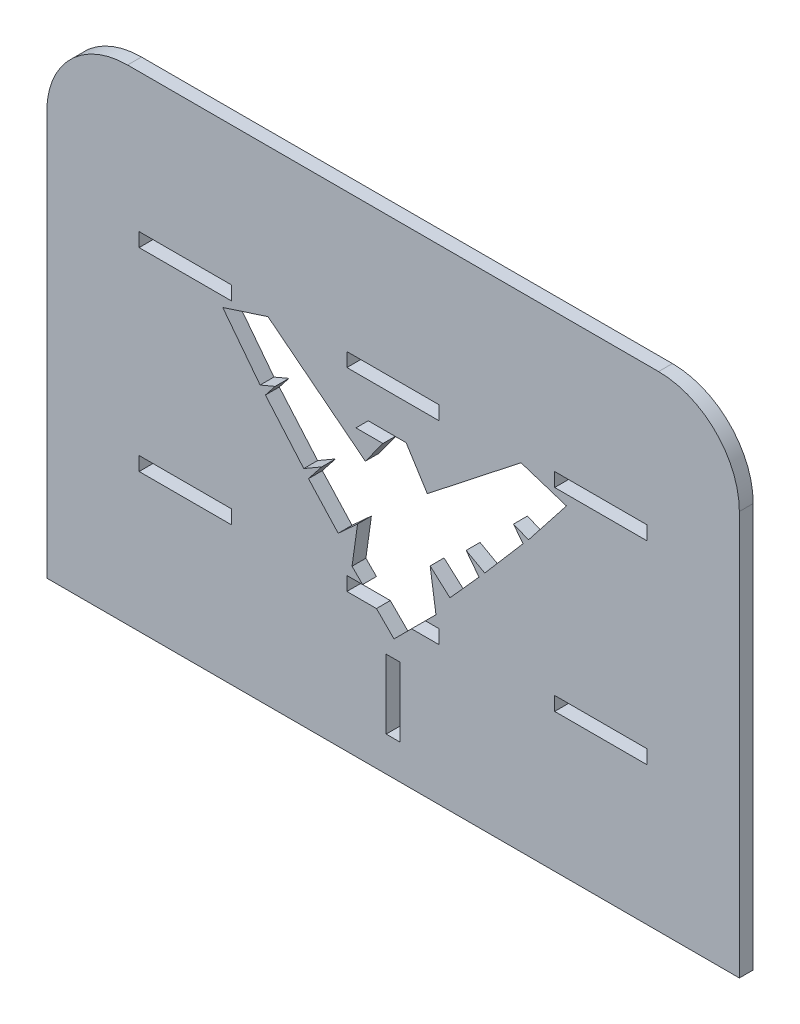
ISO-10303-21;
HEADER;
FILE_DESCRIPTION(('STEP AP214'),'2;1');
FILE_NAME('part.step','',(''),(''),'','','');
FILE_SCHEMA(('AUTOMOTIVE_DESIGN { 1 0 10303 214 1 1 1 1 }'));
ENDSEC;
DATA;
#1=APPLICATION_CONTEXT('core data for automotive mechanical design processes');
#2=APPLICATION_PROTOCOL_DEFINITION('international standard','automotive_design',2000,#1);
#3=PRODUCT_CONTEXT('',#1,'mechanical');
#4=PRODUCT('Part','Part','',(#3));
#5=PRODUCT_RELATED_PRODUCT_CATEGORY('part','',(#4));
#6=PRODUCT_DEFINITION_FORMATION('','',#4);
#7=PRODUCT_DEFINITION_CONTEXT('part definition',#1,'design');
#8=PRODUCT_DEFINITION('design','',#6,#7);
#9=PRODUCT_DEFINITION_SHAPE('','',#8);
#10=(LENGTH_UNIT() NAMED_UNIT(*) SI_UNIT(.MILLI.,.METRE.));
#11=(NAMED_UNIT(*) PLANE_ANGLE_UNIT() SI_UNIT($,.RADIAN.));
#12=(NAMED_UNIT(*) SI_UNIT($,.STERADIAN.) SOLID_ANGLE_UNIT());
#13=UNCERTAINTY_MEASURE_WITH_UNIT(LENGTH_MEASURE(1.E-05),#10,'distance_accuracy_value','');
#14=(GEOMETRIC_REPRESENTATION_CONTEXT(3) GLOBAL_UNCERTAINTY_ASSIGNED_CONTEXT((#13)) GLOBAL_UNIT_ASSIGNED_CONTEXT((#10,
#11,#12)) REPRESENTATION_CONTEXT('',''));
#15=CARTESIAN_POINT('',(0.,0.,0.));
#16=DIRECTION('',(0.,0.,1.));
#17=DIRECTION('',(1.,0.,0.));
#18=AXIS2_PLACEMENT_3D('',#15,#16,#17);
#19=CARTESIAN_POINT('',(-230.,350.,12.));
#20=DIRECTION('',(0.,0.,1.));
#21=DIRECTION('',(1.,0.,0.));
#22=AXIS2_PLACEMENT_3D('',#19,#20,#21);
#23=PLANE('',#22);
#24=DIRECTION('',(0.,-1.,0.));
#25=VECTOR('',#24,1.);
#26=CARTESIAN_POINT('',(-300.,0.,12.));
#27=LINE('',#26,#25);
#28=CARTESIAN_POINT('',(-300.,350.,12.));
#29=VERTEX_POINT('',#28);
#30=CARTESIAN_POINT('',(-300.,0.,12.));
#31=VERTEX_POINT('',#30);
#32=EDGE_CURVE('E908',#29,#31,#27,.T.);
#33=ORIENTED_EDGE('',*,*,#32,.T.);
#34=DIRECTION('',(1.,0.,0.));
#35=VECTOR('',#34,1.);
#36=CARTESIAN_POINT('',(-300.,0.,12.));
#37=LINE('',#36,#35);
#38=CARTESIAN_POINT('',(300.,0.,12.));
#39=VERTEX_POINT('',#38);
#40=EDGE_CURVE('E911',#31,#39,#37,.T.);
#41=ORIENTED_EDGE('',*,*,#40,.T.);
#42=DIRECTION('',(0.,1.,0.));
#43=VECTOR('',#42,1.);
#44=CARTESIAN_POINT('',(300.,0.,12.));
#45=LINE('',#44,#43);
#46=CARTESIAN_POINT('',(300.,350.,12.));
#47=VERTEX_POINT('',#46);
#48=EDGE_CURVE('E914',#39,#47,#45,.T.);
#49=ORIENTED_EDGE('',*,*,#48,.T.);
#50=CARTESIAN_POINT('',(230.,350.,12.));
#51=DIRECTION('',(0.,0.,1.));
#52=DIRECTION('',(1.,0.,0.));
#53=AXIS2_PLACEMENT_3D('',#50,#51,#52);
#54=CIRCLE('',#53,70.);
#55=CARTESIAN_POINT('',(230.,420.,12.));
#56=VERTEX_POINT('',#55);
#57=EDGE_CURVE('E916',#47,#56,#54,.T.);
#58=ORIENTED_EDGE('',*,*,#57,.T.);
#59=DIRECTION('',(-1.,0.,0.));
#60=VECTOR('',#59,1.);
#61=CARTESIAN_POINT('',(-230.,420.,12.));
#62=LINE('',#61,#60);
#63=CARTESIAN_POINT('',(-230.,420.,12.));
#64=VERTEX_POINT('',#63);
#65=EDGE_CURVE('E918',#56,#64,#62,.T.);
#66=ORIENTED_EDGE('',*,*,#65,.T.);
#67=CARTESIAN_POINT('',(-230.,350.,12.));
#68=DIRECTION('',(0.,0.,1.));
#69=DIRECTION('',(1.,0.,0.));
#70=AXIS2_PLACEMENT_3D('',#67,#68,#69);
#71=CIRCLE('',#70,70.);
#72=EDGE_CURVE('E920',#64,#29,#71,.T.);
#73=ORIENTED_EDGE('',*,*,#72,.T.);
#74=EDGE_LOOP('',(#33,#41,#49,#58,#66,#73));
#75=FACE_BOUND('',#74,.T.);
#76=DIRECTION('',(1.,0.,0.));
#77=VECTOR('',#76,1.);
#78=CARTESIAN_POINT('',(-140.,288.,12.));
#79=LINE('',#78,#77);
#80=CARTESIAN_POINT('',(-220.,288.,12.));
#81=VERTEX_POINT('',#80);
#82=CARTESIAN_POINT('',(-140.,288.,12.));
#83=VERTEX_POINT('',#82);
#84=EDGE_CURVE('E879',#81,#83,#79,.T.);
#85=ORIENTED_EDGE('',*,*,#84,.F.);
#86=DIRECTION('',(0.,-1.,0.));
#87=VECTOR('',#86,1.);
#88=CARTESIAN_POINT('',(-220.,288.,12.));
#89=LINE('',#88,#87);
#90=CARTESIAN_POINT('',(-220.,300.,12.));
#91=VERTEX_POINT('',#90);
#92=EDGE_CURVE('E877',#91,#81,#89,.T.);
#93=ORIENTED_EDGE('',*,*,#92,.F.);
#94=DIRECTION('',(-1.,0.,0.));
#95=VECTOR('',#94,1.);
#96=CARTESIAN_POINT('',(-140.,300.,12.));
#97=LINE('',#96,#95);
#98=CARTESIAN_POINT('',(-140.,300.,12.));
#99=VERTEX_POINT('',#98);
#100=EDGE_CURVE('E885',#99,#91,#97,.T.);
#101=ORIENTED_EDGE('',*,*,#100,.F.);
#102=DIRECTION('',(0.,1.,0.));
#103=VECTOR('',#102,1.);
#104=CARTESIAN_POINT('',(-140.,288.,12.));
#105=LINE('',#104,#103);
#106=EDGE_CURVE('E882',#83,#99,#105,.T.);
#107=ORIENTED_EDGE('',*,*,#106,.F.);
#108=EDGE_LOOP('',(#85,#93,#101,#107));
#109=FACE_BOUND('',#108,.T.);
#110=DIRECTION('',(0.,1.,0.));
#111=VECTOR('',#110,1.);
#112=CARTESIAN_POINT('',(220.,288.,12.));
#113=LINE('',#112,#111);
#114=CARTESIAN_POINT('',(220.,288.,12.));
#115=VERTEX_POINT('',#114);
#116=CARTESIAN_POINT('',(220.,300.,12.));
#117=VERTEX_POINT('',#116);
#118=EDGE_CURVE('E848',#115,#117,#113,.T.);
#119=ORIENTED_EDGE('',*,*,#118,.F.);
#120=DIRECTION('',(1.,0.,0.));
#121=VECTOR('',#120,1.);
#122=CARTESIAN_POINT('',(140.,288.,12.));
#123=LINE('',#122,#121);
#124=CARTESIAN_POINT('',(140.,288.,12.));
#125=VERTEX_POINT('',#124);
#126=EDGE_CURVE('E846',#125,#115,#123,.T.);
#127=ORIENTED_EDGE('',*,*,#126,.F.);
#128=DIRECTION('',(0.,-1.,0.));
#129=VECTOR('',#128,1.);
#130=CARTESIAN_POINT('',(140.,288.,12.));
#131=LINE('',#130,#129);
#132=CARTESIAN_POINT('',(140.,300.,12.));
#133=VERTEX_POINT('',#132);
#134=EDGE_CURVE('E854',#133,#125,#131,.T.);
#135=ORIENTED_EDGE('',*,*,#134,.F.);
#136=DIRECTION('',(-1.,0.,0.));
#137=VECTOR('',#136,1.);
#138=CARTESIAN_POINT('',(140.,300.,12.));
#139=LINE('',#138,#137);
#140=EDGE_CURVE('E851',#117,#133,#139,.T.);
#141=ORIENTED_EDGE('',*,*,#140,.F.);
#142=EDGE_LOOP('',(#119,#127,#135,#141));
#143=FACE_BOUND('',#142,.T.);
#144=DIRECTION('',(-1.,0.,0.));
#145=VECTOR('',#144,1.);
#146=CARTESIAN_POINT('',(-40.,300.,12.));
#147=LINE('',#146,#145);
#148=CARTESIAN_POINT('',(40.,300.,12.));
#149=VERTEX_POINT('',#148);
#150=CARTESIAN_POINT('',(-40.,300.,12.));
#151=VERTEX_POINT('',#150);
#152=EDGE_CURVE('E817',#149,#151,#147,.T.);
#153=ORIENTED_EDGE('',*,*,#152,.F.);
#154=DIRECTION('',(0.,1.,0.));
#155=VECTOR('',#154,1.);
#156=CARTESIAN_POINT('',(40.,288.,12.));
#157=LINE('',#156,#155);
#158=CARTESIAN_POINT('',(40.,288.,12.));
#159=VERTEX_POINT('',#158);
#160=EDGE_CURVE('E815',#159,#149,#157,.T.);
#161=ORIENTED_EDGE('',*,*,#160,.F.);
#162=DIRECTION('',(1.,0.,0.));
#163=VECTOR('',#162,1.);
#164=CARTESIAN_POINT('',(-40.,288.,12.));
#165=LINE('',#164,#163);
#166=CARTESIAN_POINT('',(-40.,288.,12.));
#167=VERTEX_POINT('',#166);
#168=EDGE_CURVE('E823',#167,#159,#165,.T.);
#169=ORIENTED_EDGE('',*,*,#168,.F.);
#170=DIRECTION('',(0.,-1.,0.));
#171=VECTOR('',#170,1.);
#172=CARTESIAN_POINT('',(-40.,288.,12.));
#173=LINE('',#172,#171);
#174=EDGE_CURVE('E820',#151,#167,#173,.T.);
#175=ORIENTED_EDGE('',*,*,#174,.F.);
#176=EDGE_LOOP('',(#153,#161,#169,#175));
#177=FACE_BOUND('',#176,.T.);
#178=DIRECTION('',(1.,0.,0.));
#179=VECTOR('',#178,1.);
#180=CARTESIAN_POINT('',(140.,120.,12.));
#181=LINE('',#180,#179);
#182=CARTESIAN_POINT('',(140.,120.,12.));
#183=VERTEX_POINT('',#182);
#184=CARTESIAN_POINT('',(220.,120.,12.));
#185=VERTEX_POINT('',#184);
#186=EDGE_CURVE('E749',#183,#185,#181,.T.);
#187=ORIENTED_EDGE('',*,*,#186,.F.);
#188=DIRECTION('',(0.,-1.,0.));
#189=VECTOR('',#188,1.);
#190=CARTESIAN_POINT('',(140.,132.,12.));
#191=LINE('',#190,#189);
#192=CARTESIAN_POINT('',(140.,132.,12.));
#193=VERTEX_POINT('',#192);
#194=EDGE_CURVE('E747',#193,#183,#191,.T.);
#195=ORIENTED_EDGE('',*,*,#194,.F.);
#196=DIRECTION('',(-1.,0.,0.));
#197=VECTOR('',#196,1.);
#198=CARTESIAN_POINT('',(140.,132.,12.));
#199=LINE('',#198,#197);
#200=CARTESIAN_POINT('',(220.,132.,12.));
#201=VERTEX_POINT('',#200);
#202=EDGE_CURVE('E755',#201,#193,#199,.T.);
#203=ORIENTED_EDGE('',*,*,#202,.F.);
#204=DIRECTION('',(0.,1.,0.));
#205=VECTOR('',#204,1.);
#206=CARTESIAN_POINT('',(220.,132.,12.));
#207=LINE('',#206,#205);
#208=EDGE_CURVE('E752',#185,#201,#207,.T.);
#209=ORIENTED_EDGE('',*,*,#208,.F.);
#210=EDGE_LOOP('',(#187,#195,#203,#209));
#211=FACE_BOUND('',#210,.T.);
#212=DIRECTION('',(0.,-1.,0.));
#213=VECTOR('',#212,1.);
#214=CARTESIAN_POINT('',(-220.,132.,12.));
#215=LINE('',#214,#213);
#216=CARTESIAN_POINT('',(-220.,132.,12.));
#217=VERTEX_POINT('',#216);
#218=CARTESIAN_POINT('',(-220.,120.,12.));
#219=VERTEX_POINT('',#218);
#220=EDGE_CURVE('E718',#217,#219,#215,.T.);
#221=ORIENTED_EDGE('',*,*,#220,.F.);
#222=DIRECTION('',(-1.,0.,0.));
#223=VECTOR('',#222,1.);
#224=CARTESIAN_POINT('',(-140.,132.,12.));
#225=LINE('',#224,#223);
#226=CARTESIAN_POINT('',(-140.,132.,12.));
#227=VERTEX_POINT('',#226);
#228=EDGE_CURVE('E716',#227,#217,#225,.T.);
#229=ORIENTED_EDGE('',*,*,#228,.F.);
#230=DIRECTION('',(0.,1.,0.));
#231=VECTOR('',#230,1.);
#232=CARTESIAN_POINT('',(-140.,132.,12.));
#233=LINE('',#232,#231);
#234=CARTESIAN_POINT('',(-140.,120.,12.));
#235=VERTEX_POINT('',#234);
#236=EDGE_CURVE('E724',#235,#227,#233,.T.);
#237=ORIENTED_EDGE('',*,*,#236,.F.);
#238=DIRECTION('',(1.,0.,0.));
#239=VECTOR('',#238,1.);
#240=CARTESIAN_POINT('',(-140.,120.,12.));
#241=LINE('',#240,#239);
#242=EDGE_CURVE('E721',#219,#235,#241,.T.);
#243=ORIENTED_EDGE('',*,*,#242,.F.);
#244=EDGE_LOOP('',(#221,#229,#237,#243));
#245=FACE_BOUND('',#244,.T.);
#246=DIRECTION('',(1.,0.,0.));
#247=VECTOR('',#246,1.);
#248=CARTESIAN_POINT('',(5.99999999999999,30.0000000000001,12.));
#249=LINE('',#248,#247);
#250=CARTESIAN_POINT('',(-6.00000000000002,30.0000000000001,12.));
#251=VERTEX_POINT('',#250);
#252=CARTESIAN_POINT('',(5.99999999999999,30.0000000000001,12.));
#253=VERTEX_POINT('',#252);
#254=EDGE_CURVE('E687',#251,#253,#249,.T.);
#255=ORIENTED_EDGE('',*,*,#254,.F.);
#256=DIRECTION('',(0.,-1.,0.));
#257=VECTOR('',#256,1.);
#258=CARTESIAN_POINT('',(-6.00000000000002,30.0000000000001,12.));
#259=LINE('',#258,#257);
#260=CARTESIAN_POINT('',(-6.00000000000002,90.0000000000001,12.));
#261=VERTEX_POINT('',#260);
#262=EDGE_CURVE('E685',#261,#251,#259,.T.);
#263=ORIENTED_EDGE('',*,*,#262,.F.);
#264=DIRECTION('',(-1.,0.,0.));
#265=VECTOR('',#264,1.);
#266=CARTESIAN_POINT('',(5.99999999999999,90.0000000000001,12.));
#267=LINE('',#266,#265);
#268=CARTESIAN_POINT('',(5.99999999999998,90.0000000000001,12.));
#269=VERTEX_POINT('',#268);
#270=EDGE_CURVE('E693',#269,#261,#267,.T.);
#271=ORIENTED_EDGE('',*,*,#270,.F.);
#272=DIRECTION('',(0.,1.,0.));
#273=VECTOR('',#272,1.);
#274=CARTESIAN_POINT('',(5.99999999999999,30.0000000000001,12.));
#275=LINE('',#274,#273);
#276=EDGE_CURVE('E690',#253,#269,#275,.T.);
#277=ORIENTED_EDGE('',*,*,#276,.F.);
#278=EDGE_LOOP('',(#255,#263,#271,#277));
#279=FACE_BOUND('',#278,.T.);
#280=DIRECTION('',(0.707106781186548,0.707106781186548,0.));
#281=VECTOR('',#280,1.);
#282=CARTESIAN_POINT('',(0.804800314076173,104.789677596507,12.));
#283=LINE('',#282,#281);
#284=CARTESIAN_POINT('',(0.804800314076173,104.789677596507,12.));
#285=VERTEX_POINT('',#284);
#286=CARTESIAN_POINT('',(16.015122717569,120.,12.));
#287=VERTEX_POINT('',#286);
#288=EDGE_CURVE('E64',#285,#287,#283,.T.);
#289=ORIENTED_EDGE('',*,*,#288,.F.);
#290=DIRECTION('',(0.707106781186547,-0.707106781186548,0.));
#291=VECTOR('',#290,1.);
#292=CARTESIAN_POINT('',(-35.5529596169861,141.147437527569,12.));
#293=LINE('',#292,#291);
#294=CARTESIAN_POINT('',(-14.4055220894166,120.,12.));
#295=VERTEX_POINT('',#294);
#296=EDGE_CURVE('E517',#295,#285,#293,.T.);
#297=ORIENTED_EDGE('',*,*,#296,.F.);
#298=DIRECTION('',(1.,0.,0.));
#299=VECTOR('',#298,1.);
#300=CARTESIAN_POINT('',(-40.,120.,12.));
#301=LINE('',#300,#299);
#302=CARTESIAN_POINT('',(-40.,120.,12.));
#303=VERTEX_POINT('',#302);
#304=EDGE_CURVE('E785',#303,#295,#301,.T.);
#305=ORIENTED_EDGE('',*,*,#304,.F.);
#306=DIRECTION('',(0.,-1.,0.));
#307=VECTOR('',#306,1.);
#308=CARTESIAN_POINT('',(-40.,132.,12.));
#309=LINE('',#308,#307);
#310=CARTESIAN_POINT('',(-40.,132.,12.));
#311=VERTEX_POINT('',#310);
#312=EDGE_CURVE('E781',#311,#303,#309,.T.);
#313=ORIENTED_EDGE('',*,*,#312,.F.);
#314=DIRECTION('',(-1.,0.,0.));
#315=VECTOR('',#314,1.);
#316=CARTESIAN_POINT('',(-40.,132.,12.));
#317=LINE('',#316,#315);
#318=CARTESIAN_POINT('',(-26.4055220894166,132.,12.));
#319=VERTEX_POINT('',#318);
#320=EDGE_CURVE('E782',#319,#311,#317,.T.);
#321=ORIENTED_EDGE('',*,*,#320,.F.);
#322=CARTESIAN_POINT('',(-35.5529596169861,141.147437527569,12.));
#323=VERTEX_POINT('',#322);
#324=EDGE_CURVE('E518',#323,#319,#293,.T.);
#325=ORIENTED_EDGE('',*,*,#324,.F.);
#326=DIRECTION('',(-0.138829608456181,-0.990316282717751,0.));
#327=VECTOR('',#326,1.);
#328=CARTESIAN_POINT('',(-30.7726674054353,175.246800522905,12.));
#329=LINE('',#328,#327);
#330=CARTESIAN_POINT('',(-30.7726674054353,175.246800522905,12.));
#331=VERTEX_POINT('',#330);
#332=EDGE_CURVE('E515',#331,#323,#329,.T.);
#333=ORIENTED_EDGE('',*,*,#332,.F.);
#334=DIRECTION('',(0.737891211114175,0.674919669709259,0.));
#335=VECTOR('',#334,1.);
#336=CARTESIAN_POINT('',(-47.5678563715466,159.884910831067,12.));
#337=LINE('',#336,#335);
#338=CARTESIAN_POINT('',(-47.5678563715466,159.884910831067,12.));
#339=VERTEX_POINT('',#338);
#340=EDGE_CURVE('E513',#339,#331,#337,.T.);
#341=ORIENTED_EDGE('',*,*,#340,.F.);
#342=DIRECTION('',(0.674919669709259,-0.737891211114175,0.));
#343=VECTOR('',#342,1.);
#344=CARTESIAN_POINT('',(-73.2827394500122,187.999051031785,12.));
#345=LINE('',#344,#343);
#346=CARTESIAN_POINT('',(-73.2827394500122,187.999051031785,12.));
#347=VERTEX_POINT('',#346);
#348=EDGE_CURVE('E511',#347,#339,#345,.T.);
#349=ORIENTED_EDGE('',*,*,#348,.F.);
#350=DIRECTION('',(-0.61764171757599,-0.786459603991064,0.));
#351=VECTOR('',#350,1.);
#352=CARTESIAN_POINT('',(-61.913489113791,202.475819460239,12.));
#353=LINE('',#352,#351);
#354=CARTESIAN_POINT('',(-61.913489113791,202.475819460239,12.));
#355=VERTEX_POINT('',#354);
#356=EDGE_CURVE('E509',#355,#347,#353,.T.);
#357=ORIENTED_EDGE('',*,*,#356,.F.);
#358=DIRECTION('',(0.865383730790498,0.501109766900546,0.));
#359=VECTOR('',#358,1.);
#360=CARTESIAN_POINT('',(-77.3662017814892,193.527759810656,12.));
#361=LINE('',#360,#359);
#362=CARTESIAN_POINT('',(-77.3662017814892,193.527759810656,12.));
#363=VERTEX_POINT('',#362);
#364=EDGE_CURVE('E507',#363,#355,#361,.T.);
#365=ORIENTED_EDGE('',*,*,#364,.F.);
#366=DIRECTION('',(0.652794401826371,-0.757535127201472,0.));
#367=VECTOR('',#366,1.);
#368=CARTESIAN_POINT('',(-110.596076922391,232.089361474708,12.));
#369=LINE('',#368,#367);
#370=CARTESIAN_POINT('',(-110.596076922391,232.089361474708,12.));
#371=VERTEX_POINT('',#370);
#372=EDGE_CURVE('E505',#371,#363,#369,.T.);
#373=ORIENTED_EDGE('',*,*,#372,.F.);
#374=DIRECTION('',(-0.617641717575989,-0.786459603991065,0.));
#375=VECTOR('',#374,1.);
#376=CARTESIAN_POINT('',(-102.222655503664,242.751461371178,12.));
#377=LINE('',#376,#375);
#378=CARTESIAN_POINT('',(-102.222655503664,242.751461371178,12.));
#379=VERTEX_POINT('',#378);
#380=EDGE_CURVE('E503',#379,#371,#377,.T.);
#381=ORIENTED_EDGE('',*,*,#380,.F.);
#382=DIRECTION('',(0.921338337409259,0.388761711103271,0.));
#383=VECTOR('',#382,1.);
#384=CARTESIAN_POINT('',(-115.196965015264,237.276909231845,12.));
#385=LINE('',#384,#383);
#386=CARTESIAN_POINT('',(-115.196965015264,237.276909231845,12.));
#387=VERTEX_POINT('',#386);
#388=EDGE_CURVE('E501',#387,#379,#385,.T.);
#389=ORIENTED_EDGE('',*,*,#388,.F.);
#390=DIRECTION('',(0.610412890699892,-0.792083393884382,0.));
#391=VECTOR('',#390,1.);
#392=CARTESIAN_POINT('',(-147.568509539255,279.282842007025,12.));
#393=LINE('',#392,#391);
#394=CARTESIAN_POINT('',(-147.568509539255,279.282842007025,12.));
#395=VERTEX_POINT('',#394);
#396=EDGE_CURVE('E499',#395,#387,#393,.T.);
#397=ORIENTED_EDGE('',*,*,#396,.F.);
#398=DIRECTION('',(-0.951148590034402,-0.308733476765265,0.));
#399=VECTOR('',#398,1.);
#400=CARTESIAN_POINT('',(-108.388663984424,292.000234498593,12.));
#401=LINE('',#400,#399);
#402=CARTESIAN_POINT('',(-108.388663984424,292.000234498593,12.));
#403=VERTEX_POINT('',#402);
#404=EDGE_CURVE('E497',#403,#395,#401,.T.);
#405=ORIENTED_EDGE('',*,*,#404,.F.);
#406=DIRECTION('',(-0.786459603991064,0.61764171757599,0.));
#407=VECTOR('',#406,1.);
#408=CARTESIAN_POINT('',(-24.0084030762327,225.732661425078,12.));
#409=LINE('',#408,#407);
#410=CARTESIAN_POINT('',(-24.0084030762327,225.732661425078,12.));
#411=VERTEX_POINT('',#410);
#412=EDGE_CURVE('E495',#411,#403,#409,.T.);
#413=ORIENTED_EDGE('',*,*,#412,.F.);
#414=DIRECTION('',(-0.588593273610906,-0.808429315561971,0.));
#415=VECTOR('',#414,1.);
#416=CARTESIAN_POINT('',(-8.77864139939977,246.650647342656,12.));
#417=LINE('',#416,#415);
#418=CARTESIAN_POINT('',(-8.77864139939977,246.650647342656,12.));
#419=VERTEX_POINT('',#418);
#420=EDGE_CURVE('E493',#419,#411,#417,.T.);
#421=ORIENTED_EDGE('',*,*,#420,.F.);
#422=DIRECTION('',(1.,0.,0.));
#423=VECTOR('',#422,1.);
#424=CARTESIAN_POINT('',(-32.1737572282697,246.650647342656,12.));
#425=LINE('',#424,#423);
#426=CARTESIAN_POINT('',(-32.1737572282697,246.650647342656,12.));
#427=VERTEX_POINT('',#426);
#428=EDGE_CURVE('E491',#427,#419,#425,.T.);
#429=ORIENTED_EDGE('',*,*,#428,.F.);
#430=DIRECTION('',(-0.707106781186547,-0.707106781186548,0.));
#431=VECTOR('',#430,1.);
#432=CARTESIAN_POINT('',(-21.5312731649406,257.293131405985,12.));
#433=LINE('',#432,#431);
#434=CARTESIAN_POINT('',(-21.5312731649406,257.293131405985,12.));
#435=VERTEX_POINT('',#434);
#436=EDGE_CURVE('E487',#435,#427,#433,.T.);
#437=ORIENTED_EDGE('',*,*,#436,.F.);
#438=DIRECTION('',(-1.,0.,0.));
#439=VECTOR('',#438,1.);
#440=CARTESIAN_POINT('',(11.3136345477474,257.293131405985,12.));
#441=LINE('',#440,#439);
#442=CARTESIAN_POINT('',(11.3136345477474,257.293131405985,12.));
#443=VERTEX_POINT('',#442);
#444=EDGE_CURVE('E485',#443,#435,#441,.T.);
#445=ORIENTED_EDGE('',*,*,#444,.F.);
#446=DIRECTION('',(-0.533591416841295,0.845742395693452,0.));
#447=VECTOR('',#446,1.);
#448=CARTESIAN_POINT('',(29.662745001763,228.209791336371,12.));
#449=LINE('',#448,#447);
#450=CARTESIAN_POINT('',(29.662745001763,228.209791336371,12.));
#451=VERTEX_POINT('',#450);
#452=EDGE_CURVE('E472',#451,#443,#449,.T.);
#453=ORIENTED_EDGE('',*,*,#452,.F.);
#454=DIRECTION('',(-0.786289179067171,-0.617858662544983,0.));
#455=VECTOR('',#454,1.);
#456=CARTESIAN_POINT('',(110.842694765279,292.000234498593,12.));
#457=LINE('',#456,#455);
#458=CARTESIAN_POINT('',(110.842694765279,292.000234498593,12.));
#459=VERTEX_POINT('',#458);
#460=EDGE_CURVE('E462',#459,#451,#457,.T.);
#461=ORIENTED_EDGE('',*,*,#460,.F.);
#462=DIRECTION('',(-0.951574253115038,0.307418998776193,0.));
#463=VECTOR('',#462,1.);
#464=CARTESIAN_POINT('',(150.207676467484,279.282842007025,12.));
#465=LINE('',#464,#463);
#466=CARTESIAN_POINT('',(150.207676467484,279.282842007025,12.));
#467=VERTEX_POINT('',#466);
#468=EDGE_CURVE('E540',#467,#459,#465,.T.);
#469=ORIENTED_EDGE('',*,*,#468,.F.);
#470=DIRECTION('',(0.61764171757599,0.786459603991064,0.));
#471=VECTOR('',#470,1.);
#472=CARTESIAN_POINT('',(117.331247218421,237.420411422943,12.));
#473=LINE('',#472,#471);
#474=CARTESIAN_POINT('',(117.331247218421,237.420411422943,12.));
#475=VERTEX_POINT('',#474);
#476=EDGE_CURVE('E538',#475,#467,#473,.T.);
#477=ORIENTED_EDGE('',*,*,#476,.F.);
#478=DIRECTION('',(0.924990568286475,-0.379990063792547,0.));
#479=VECTOR('',#478,1.);
#480=CARTESIAN_POINT('',(104.354142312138,242.751461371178,12.));
#481=LINE('',#480,#479);
#482=CARTESIAN_POINT('',(104.354142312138,242.751461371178,12.));
#483=VERTEX_POINT('',#482);
#484=EDGE_CURVE('E536',#483,#475,#481,.T.);
#485=ORIENTED_EDGE('',*,*,#484,.F.);
#486=DIRECTION('',(-0.610412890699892,0.792083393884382,0.));
#487=VECTOR('',#486,1.);
#488=CARTESIAN_POINT('',(112.570806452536,232.089361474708,12.));
#489=LINE('',#488,#487);
#490=CARTESIAN_POINT('',(112.570806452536,232.089361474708,12.));
#491=VERTEX_POINT('',#490);
#492=EDGE_CURVE('E534',#491,#483,#489,.T.);
#493=ORIENTED_EDGE('',*,*,#492,.F.);
#494=DIRECTION('',(0.65190609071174,0.758299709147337,0.));
#495=VECTOR('',#494,1.);
#496=CARTESIAN_POINT('',(79.4196095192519,193.527759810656,12.));
#497=LINE('',#496,#495);
#498=CARTESIAN_POINT('',(79.4196095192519,193.527759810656,12.));
#499=VERTEX_POINT('',#498);
#500=EDGE_CURVE('E532',#499,#491,#497,.T.);
#501=ORIENTED_EDGE('',*,*,#500,.F.);
#502=DIRECTION('',(0.874215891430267,-0.485537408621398,0.));
#503=VECTOR('',#502,1.);
#504=CARTESIAN_POINT('',(63.3085214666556,202.475819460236,12.));
#505=LINE('',#504,#503);
#506=CARTESIAN_POINT('',(63.3085214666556,202.475819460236,12.));
#507=VERTEX_POINT('',#506);
#508=EDGE_CURVE('E530',#507,#499,#505,.T.);
#509=ORIENTED_EDGE('',*,*,#508,.F.);
#510=DIRECTION('',(-0.610412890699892,0.792083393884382,0.));
#511=VECTOR('',#510,1.);
#512=CARTESIAN_POINT('',(74.4649301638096,187.999051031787,12.));
#513=LINE('',#512,#511);
#514=CARTESIAN_POINT('',(74.4649301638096,187.999051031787,12.));
#515=VERTEX_POINT('',#514);
#516=EDGE_CURVE('E528',#515,#507,#513,.T.);
#517=ORIENTED_EDGE('',*,*,#516,.F.);
#518=DIRECTION('',(0.667388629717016,0.744709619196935,0.));
#519=VECTOR('',#518,1.);
#520=CARTESIAN_POINT('',(49.2697976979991,159.884910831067,12.));
#521=LINE('',#520,#519);
#522=CARTESIAN_POINT('',(49.2697976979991,159.884910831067,12.));
#523=VERTEX_POINT('',#522);
#524=EDGE_CURVE('E526',#523,#515,#521,.T.);
#525=ORIENTED_EDGE('',*,*,#524,.F.);
#526=DIRECTION('',(0.744709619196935,-0.667388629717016,0.));
#527=VECTOR('',#526,1.);
#528=CARTESIAN_POINT('',(32.1281406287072,175.246800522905,12.));
#529=LINE('',#528,#527);
#530=CARTESIAN_POINT('',(32.1281406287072,175.246800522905,12.));
#531=VERTEX_POINT('',#530);
#532=EDGE_CURVE('E524',#531,#523,#529,.T.);
#533=ORIENTED_EDGE('',*,*,#532,.F.);
#534=DIRECTION('',(-0.146056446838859,0.989276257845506,0.));
#535=VECTOR('',#534,1.);
#536=CARTESIAN_POINT('',(37.1625602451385,141.14743752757,12.));
#537=LINE('',#536,#535);
#538=CARTESIAN_POINT('',(37.1625602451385,141.14743752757,12.));
#539=VERTEX_POINT('',#538);
#540=EDGE_CURVE('E522',#539,#531,#537,.T.);
#541=ORIENTED_EDGE('',*,*,#540,.F.);
#542=CARTESIAN_POINT('',(28.015122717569,132.,12.));
#543=VERTEX_POINT('',#542);
#544=EDGE_CURVE('E520',#543,#539,#283,.T.);
#545=ORIENTED_EDGE('',*,*,#544,.F.);
#546=CARTESIAN_POINT('',(40.,132.,12.));
#547=VERTEX_POINT('',#546);
#548=EDGE_CURVE('E778',#547,#543,#317,.T.);
#549=ORIENTED_EDGE('',*,*,#548,.F.);
#550=DIRECTION('',(0.,1.,0.));
#551=VECTOR('',#550,1.);
#552=CARTESIAN_POINT('',(40.,132.,12.));
#553=LINE('',#552,#551);
#554=CARTESIAN_POINT('',(39.9999999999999,120.,12.));
#555=VERTEX_POINT('',#554);
#556=EDGE_CURVE('E788',#555,#547,#553,.T.);
#557=ORIENTED_EDGE('',*,*,#556,.F.);
#558=EDGE_CURVE('E784',#287,#555,#301,.T.);
#559=ORIENTED_EDGE('',*,*,#558,.F.);
#560=EDGE_LOOP('',(#289,#297,#305,#313,#321,#325,#333,#341,#349,#357,#365,#373,#381,#389,#397,
#405,#413,#421,#429,#437,#445,#453,#461,#469,#477,#485,#493,#501,#509,#517,#525,#533,#541,#545,
#549,#557,#559));
#561=FACE_BOUND('',#560,.T.);
#562=ADVANCED_FACE('F41',(#75,#109,#143,#177,#211,#245,#279,#561),#23,.T.);
#563=CARTESIAN_POINT('',(-230.,350.,0.));
#564=DIRECTION('',(0.,0.,1.));
#565=DIRECTION('',(1.,0.,0.));
#566=AXIS2_PLACEMENT_3D('',#563,#564,#565);
#567=PLANE('',#566);
#568=DIRECTION('',(-1.,0.,0.));
#569=VECTOR('',#568,1.);
#570=CARTESIAN_POINT('',(-140.,132.,0.));
#571=LINE('',#570,#569);
#572=CARTESIAN_POINT('',(-140.,132.,0.));
#573=VERTEX_POINT('',#572);
#574=CARTESIAN_POINT('',(-220.,132.,0.));
#575=VERTEX_POINT('',#574);
#576=EDGE_CURVE('E715',#573,#575,#571,.T.);
#577=ORIENTED_EDGE('',*,*,#576,.T.);
#578=DIRECTION('',(0.,-1.,0.));
#579=VECTOR('',#578,1.);
#580=CARTESIAN_POINT('',(-220.,132.,0.));
#581=LINE('',#580,#579);
#582=CARTESIAN_POINT('',(-220.,120.,0.));
#583=VERTEX_POINT('',#582);
#584=EDGE_CURVE('E729',#575,#583,#581,.T.);
#585=ORIENTED_EDGE('',*,*,#584,.T.);
#586=DIRECTION('',(1.,0.,0.));
#587=VECTOR('',#586,1.);
#588=CARTESIAN_POINT('',(-140.,120.,0.));
#589=LINE('',#588,#587);
#590=CARTESIAN_POINT('',(-140.,120.,0.));
#591=VERTEX_POINT('',#590);
#592=EDGE_CURVE('E732',#583,#591,#589,.T.);
#593=ORIENTED_EDGE('',*,*,#592,.T.);
#594=DIRECTION('',(0.,1.,0.));
#595=VECTOR('',#594,1.);
#596=CARTESIAN_POINT('',(-140.,132.,0.));
#597=LINE('',#596,#595);
#598=EDGE_CURVE('E719',#591,#573,#597,.T.);
#599=ORIENTED_EDGE('',*,*,#598,.T.);
#600=EDGE_LOOP('',(#577,#585,#593,#599));
#601=FACE_BOUND('',#600,.T.);
#602=DIRECTION('',(1.,0.,0.));
#603=VECTOR('',#602,1.);
#604=CARTESIAN_POINT('',(140.,288.,0.));
#605=LINE('',#604,#603);
#606=CARTESIAN_POINT('',(140.,288.,0.));
#607=VERTEX_POINT('',#606);
#608=CARTESIAN_POINT('',(220.,288.,0.));
#609=VERTEX_POINT('',#608);
#610=EDGE_CURVE('E845',#607,#609,#605,.T.);
#611=ORIENTED_EDGE('',*,*,#610,.T.);
#612=DIRECTION('',(0.,1.,0.));
#613=VECTOR('',#612,1.);
#614=CARTESIAN_POINT('',(220.,288.,0.));
#615=LINE('',#614,#613);
#616=CARTESIAN_POINT('',(220.,300.,0.));
#617=VERTEX_POINT('',#616);
#618=EDGE_CURVE('E859',#609,#617,#615,.T.);
#619=ORIENTED_EDGE('',*,*,#618,.T.);
#620=DIRECTION('',(-1.,0.,0.));
#621=VECTOR('',#620,1.);
#622=CARTESIAN_POINT('',(140.,300.,0.));
#623=LINE('',#622,#621);
#624=CARTESIAN_POINT('',(140.,300.,0.));
#625=VERTEX_POINT('',#624);
#626=EDGE_CURVE('E862',#617,#625,#623,.T.);
#627=ORIENTED_EDGE('',*,*,#626,.T.);
#628=DIRECTION('',(0.,-1.,0.));
#629=VECTOR('',#628,1.);
#630=CARTESIAN_POINT('',(140.,288.,0.));
#631=LINE('',#630,#629);
#632=EDGE_CURVE('E849',#625,#607,#631,.T.);
#633=ORIENTED_EDGE('',*,*,#632,.T.);
#634=EDGE_LOOP('',(#611,#619,#627,#633));
#635=FACE_BOUND('',#634,.T.);
#636=DIRECTION('',(0.,-1.,0.));
#637=VECTOR('',#636,1.);
#638=CARTESIAN_POINT('',(-300.,0.,0.));
#639=LINE('',#638,#637);
#640=CARTESIAN_POINT('',(-300.,350.,0.));
#641=VERTEX_POINT('',#640);
#642=CARTESIAN_POINT('',(-300.,0.,0.));
#643=VERTEX_POINT('',#642);
#644=EDGE_CURVE('E907',#641,#643,#639,.T.);
#645=ORIENTED_EDGE('',*,*,#644,.F.);
#646=CARTESIAN_POINT('',(-230.,350.,0.));
#647=DIRECTION('',(0.,0.,1.));
#648=DIRECTION('',(1.,0.,0.));
#649=AXIS2_PLACEMENT_3D('',#646,#647,#648);
#650=CIRCLE('',#649,70.);
#651=CARTESIAN_POINT('',(-230.,420.,0.));
#652=VERTEX_POINT('',#651);
#653=EDGE_CURVE('E912',#652,#641,#650,.T.);
#654=ORIENTED_EDGE('',*,*,#653,.F.);
#655=DIRECTION('',(-1.,0.,0.));
#656=VECTOR('',#655,1.);
#657=CARTESIAN_POINT('',(-230.,420.,0.));
#658=LINE('',#657,#656);
#659=CARTESIAN_POINT('',(230.,420.,0.));
#660=VERTEX_POINT('',#659);
#661=EDGE_CURVE('E931',#660,#652,#658,.T.);
#662=ORIENTED_EDGE('',*,*,#661,.F.);
#663=CARTESIAN_POINT('',(230.,350.,0.));
#664=DIRECTION('',(0.,0.,1.));
#665=DIRECTION('',(1.,0.,0.));
#666=AXIS2_PLACEMENT_3D('',#663,#664,#665);
#667=CIRCLE('',#666,70.);
#668=CARTESIAN_POINT('',(300.,350.,0.));
#669=VERTEX_POINT('',#668);
#670=EDGE_CURVE('E929',#669,#660,#667,.T.);
#671=ORIENTED_EDGE('',*,*,#670,.F.);
#672=DIRECTION('',(0.,1.,0.));
#673=VECTOR('',#672,1.);
#674=CARTESIAN_POINT('',(300.,0.,0.));
#675=LINE('',#674,#673);
#676=CARTESIAN_POINT('',(300.,0.,0.));
#677=VERTEX_POINT('',#676);
#678=EDGE_CURVE('E927',#677,#669,#675,.T.);
#679=ORIENTED_EDGE('',*,*,#678,.F.);
#680=DIRECTION('',(1.,0.,0.));
#681=VECTOR('',#680,1.);
#682=CARTESIAN_POINT('',(-300.,0.,0.));
#683=LINE('',#682,#681);
#684=EDGE_CURVE('E925',#643,#677,#683,.T.);
#685=ORIENTED_EDGE('',*,*,#684,.F.);
#686=EDGE_LOOP('',(#645,#654,#662,#671,#679,#685));
#687=FACE_BOUND('',#686,.T.);
#688=DIRECTION('',(0.,-1.,0.));
#689=VECTOR('',#688,1.);
#690=CARTESIAN_POINT('',(-220.,288.,0.));
#691=LINE('',#690,#689);
#692=CARTESIAN_POINT('',(-220.,300.,0.));
#693=VERTEX_POINT('',#692);
#694=CARTESIAN_POINT('',(-220.,288.,0.));
#695=VERTEX_POINT('',#694);
#696=EDGE_CURVE('E876',#693,#695,#691,.T.);
#697=ORIENTED_EDGE('',*,*,#696,.T.);
#698=DIRECTION('',(1.,0.,0.));
#699=VECTOR('',#698,1.);
#700=CARTESIAN_POINT('',(-140.,288.,0.));
#701=LINE('',#700,#699);
#702=CARTESIAN_POINT('',(-140.,288.,0.));
#703=VERTEX_POINT('',#702);
#704=EDGE_CURVE('E890',#695,#703,#701,.T.);
#705=ORIENTED_EDGE('',*,*,#704,.T.);
#706=DIRECTION('',(0.,1.,0.));
#707=VECTOR('',#706,1.);
#708=CARTESIAN_POINT('',(-140.,288.,0.));
#709=LINE('',#708,#707);
#710=CARTESIAN_POINT('',(-140.,300.,0.));
#711=VERTEX_POINT('',#710);
#712=EDGE_CURVE('E893',#703,#711,#709,.T.);
#713=ORIENTED_EDGE('',*,*,#712,.T.);
#714=DIRECTION('',(-1.,0.,0.));
#715=VECTOR('',#714,1.);
#716=CARTESIAN_POINT('',(-140.,300.,0.));
#717=LINE('',#716,#715);
#718=EDGE_CURVE('E880',#711,#693,#717,.T.);
#719=ORIENTED_EDGE('',*,*,#718,.T.);
#720=EDGE_LOOP('',(#697,#705,#713,#719));
#721=FACE_BOUND('',#720,.T.);
#722=DIRECTION('',(0.,1.,0.));
#723=VECTOR('',#722,1.);
#724=CARTESIAN_POINT('',(40.,288.,0.));
#725=LINE('',#724,#723);
#726=CARTESIAN_POINT('',(40.,288.,0.));
#727=VERTEX_POINT('',#726);
#728=CARTESIAN_POINT('',(40.,300.,0.));
#729=VERTEX_POINT('',#728);
#730=EDGE_CURVE('E814',#727,#729,#725,.T.);
#731=ORIENTED_EDGE('',*,*,#730,.T.);
#732=DIRECTION('',(-1.,0.,0.));
#733=VECTOR('',#732,1.);
#734=CARTESIAN_POINT('',(-40.,300.,0.));
#735=LINE('',#734,#733);
#736=CARTESIAN_POINT('',(-40.,300.,0.));
#737=VERTEX_POINT('',#736);
#738=EDGE_CURVE('E828',#729,#737,#735,.T.);
#739=ORIENTED_EDGE('',*,*,#738,.T.);
#740=DIRECTION('',(0.,-1.,0.));
#741=VECTOR('',#740,1.);
#742=CARTESIAN_POINT('',(-40.,288.,0.));
#743=LINE('',#742,#741);
#744=CARTESIAN_POINT('',(-40.,288.,0.));
#745=VERTEX_POINT('',#744);
#746=EDGE_CURVE('E831',#737,#745,#743,.T.);
#747=ORIENTED_EDGE('',*,*,#746,.T.);
#748=DIRECTION('',(1.,0.,0.));
#749=VECTOR('',#748,1.);
#750=CARTESIAN_POINT('',(-40.,288.,0.));
#751=LINE('',#750,#749);
#752=EDGE_CURVE('E818',#745,#727,#751,.T.);
#753=ORIENTED_EDGE('',*,*,#752,.T.);
#754=EDGE_LOOP('',(#731,#739,#747,#753));
#755=FACE_BOUND('',#754,.T.);
#756=DIRECTION('',(0.,-1.,0.));
#757=VECTOR('',#756,1.);
#758=CARTESIAN_POINT('',(140.,132.,0.));
#759=LINE('',#758,#757);
#760=CARTESIAN_POINT('',(140.,132.,0.));
#761=VERTEX_POINT('',#760);
#762=CARTESIAN_POINT('',(140.,120.,0.));
#763=VERTEX_POINT('',#762);
#764=EDGE_CURVE('E746',#761,#763,#759,.T.);
#765=ORIENTED_EDGE('',*,*,#764,.T.);
#766=DIRECTION('',(1.,0.,0.));
#767=VECTOR('',#766,1.);
#768=CARTESIAN_POINT('',(140.,120.,0.));
#769=LINE('',#768,#767);
#770=CARTESIAN_POINT('',(220.,120.,0.));
#771=VERTEX_POINT('',#770);
#772=EDGE_CURVE('E760',#763,#771,#769,.T.);
#773=ORIENTED_EDGE('',*,*,#772,.T.);
#774=DIRECTION('',(0.,1.,0.));
#775=VECTOR('',#774,1.);
#776=CARTESIAN_POINT('',(220.,132.,0.));
#777=LINE('',#776,#775);
#778=CARTESIAN_POINT('',(220.,132.,0.));
#779=VERTEX_POINT('',#778);
#780=EDGE_CURVE('E763',#771,#779,#777,.T.);
#781=ORIENTED_EDGE('',*,*,#780,.T.);
#782=DIRECTION('',(-1.,0.,0.));
#783=VECTOR('',#782,1.);
#784=CARTESIAN_POINT('',(140.,132.,0.));
#785=LINE('',#784,#783);
#786=EDGE_CURVE('E750',#779,#761,#785,.T.);
#787=ORIENTED_EDGE('',*,*,#786,.T.);
#788=EDGE_LOOP('',(#765,#773,#781,#787));
#789=FACE_BOUND('',#788,.T.);
#790=DIRECTION('',(0.,-1.,0.));
#791=VECTOR('',#790,1.);
#792=CARTESIAN_POINT('',(-6.00000000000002,30.0000000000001,0.));
#793=LINE('',#792,#791);
#794=CARTESIAN_POINT('',(-6.00000000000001,90.0000000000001,0.));
#795=VERTEX_POINT('',#794);
#796=CARTESIAN_POINT('',(-6.00000000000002,30.0000000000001,0.));
#797=VERTEX_POINT('',#796);
#798=EDGE_CURVE('E684',#795,#797,#793,.T.);
#799=ORIENTED_EDGE('',*,*,#798,.T.);
#800=DIRECTION('',(1.,0.,0.));
#801=VECTOR('',#800,1.);
#802=CARTESIAN_POINT('',(5.99999999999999,30.0000000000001,0.));
#803=LINE('',#802,#801);
#804=CARTESIAN_POINT('',(5.99999999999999,30.0000000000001,0.));
#805=VERTEX_POINT('',#804);
#806=EDGE_CURVE('E698',#797,#805,#803,.T.);
#807=ORIENTED_EDGE('',*,*,#806,.T.);
#808=DIRECTION('',(0.,1.,0.));
#809=VECTOR('',#808,1.);
#810=CARTESIAN_POINT('',(5.99999999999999,30.0000000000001,0.));
#811=LINE('',#810,#809);
#812=CARTESIAN_POINT('',(5.99999999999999,90.0000000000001,0.));
#813=VERTEX_POINT('',#812);
#814=EDGE_CURVE('E701',#805,#813,#811,.T.);
#815=ORIENTED_EDGE('',*,*,#814,.T.);
#816=DIRECTION('',(-1.,0.,0.));
#817=VECTOR('',#816,1.);
#818=CARTESIAN_POINT('',(5.99999999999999,90.0000000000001,0.));
#819=LINE('',#818,#817);
#820=EDGE_CURVE('E688',#813,#795,#819,.T.);
#821=ORIENTED_EDGE('',*,*,#820,.T.);
#822=EDGE_LOOP('',(#799,#807,#815,#821));
#823=FACE_BOUND('',#822,.T.);
#824=DIRECTION('',(0.707106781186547,-0.707106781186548,0.));
#825=VECTOR('',#824,1.);
#826=CARTESIAN_POINT('',(-35.5529596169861,141.147437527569,0.));
#827=LINE('',#826,#825);
#828=CARTESIAN_POINT('',(-14.4055220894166,120.,0.));
#829=VERTEX_POINT('',#828);
#830=CARTESIAN_POINT('',(0.804800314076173,104.789677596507,0.));
#831=VERTEX_POINT('',#830);
#832=EDGE_CURVE('E590',#829,#831,#827,.T.);
#833=ORIENTED_EDGE('',*,*,#832,.T.);
#834=DIRECTION('',(0.707106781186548,0.707106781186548,0.));
#835=VECTOR('',#834,1.);
#836=CARTESIAN_POINT('',(0.804800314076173,104.789677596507,0.));
#837=LINE('',#836,#835);
#838=CARTESIAN_POINT('',(16.015122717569,120.,0.));
#839=VERTEX_POINT('',#838);
#840=EDGE_CURVE('E594',#831,#839,#837,.T.);
#841=ORIENTED_EDGE('',*,*,#840,.T.);
#842=DIRECTION('',(1.,0.,0.));
#843=VECTOR('',#842,1.);
#844=CARTESIAN_POINT('',(-40.,120.,0.));
#845=LINE('',#844,#843);
#846=CARTESIAN_POINT('',(39.9999999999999,120.,0.));
#847=VERTEX_POINT('',#846);
#848=EDGE_CURVE('E797',#839,#847,#845,.T.);
#849=ORIENTED_EDGE('',*,*,#848,.T.);
#850=DIRECTION('',(0.,1.,0.));
#851=VECTOR('',#850,1.);
#852=CARTESIAN_POINT('',(40.,132.,0.));
#853=LINE('',#852,#851);
#854=CARTESIAN_POINT('',(40.,132.,0.));
#855=VERTEX_POINT('',#854);
#856=EDGE_CURVE('E801',#847,#855,#853,.T.);
#857=ORIENTED_EDGE('',*,*,#856,.T.);
#858=DIRECTION('',(-1.,0.,0.));
#859=VECTOR('',#858,1.);
#860=CARTESIAN_POINT('',(-40.,132.,0.));
#861=LINE('',#860,#859);
#862=CARTESIAN_POINT('',(28.015122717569,132.,0.));
#863=VERTEX_POINT('',#862);
#864=EDGE_CURVE('E791',#855,#863,#861,.T.);
#865=ORIENTED_EDGE('',*,*,#864,.T.);
#866=CARTESIAN_POINT('',(37.1625602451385,141.14743752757,0.));
#867=VERTEX_POINT('',#866);
#868=EDGE_CURVE('E56',#863,#867,#837,.T.);
#869=ORIENTED_EDGE('',*,*,#868,.T.);
#870=DIRECTION('',(-0.146056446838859,0.989276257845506,0.));
#871=VECTOR('',#870,1.);
#872=CARTESIAN_POINT('',(37.1625602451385,141.14743752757,0.));
#873=LINE('',#872,#871);
#874=CARTESIAN_POINT('',(32.1281406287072,175.246800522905,0.));
#875=VERTEX_POINT('',#874);
#876=EDGE_CURVE('E597',#867,#875,#873,.T.);
#877=ORIENTED_EDGE('',*,*,#876,.T.);
#878=DIRECTION('',(0.744709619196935,-0.667388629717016,0.));
#879=VECTOR('',#878,1.);
#880=CARTESIAN_POINT('',(32.1281406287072,175.246800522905,0.));
#881=LINE('',#880,#879);
#882=CARTESIAN_POINT('',(49.2697976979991,159.884910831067,0.));
#883=VERTEX_POINT('',#882);
#884=EDGE_CURVE('E600',#875,#883,#881,.T.);
#885=ORIENTED_EDGE('',*,*,#884,.T.);
#886=DIRECTION('',(0.667388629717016,0.744709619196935,0.));
#887=VECTOR('',#886,1.);
#888=CARTESIAN_POINT('',(49.2697976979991,159.884910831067,0.));
#889=LINE('',#888,#887);
#890=CARTESIAN_POINT('',(74.4649301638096,187.999051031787,0.));
#891=VERTEX_POINT('',#890);
#892=EDGE_CURVE('E603',#883,#891,#889,.T.);
#893=ORIENTED_EDGE('',*,*,#892,.T.);
#894=DIRECTION('',(-0.610412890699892,0.792083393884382,0.));
#895=VECTOR('',#894,1.);
#896=CARTESIAN_POINT('',(74.4649301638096,187.999051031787,0.));
#897=LINE('',#896,#895);
#898=CARTESIAN_POINT('',(63.3085214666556,202.475819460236,0.));
#899=VERTEX_POINT('',#898);
#900=EDGE_CURVE('E606',#891,#899,#897,.T.);
#901=ORIENTED_EDGE('',*,*,#900,.T.);
#902=DIRECTION('',(0.874215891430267,-0.485537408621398,0.));
#903=VECTOR('',#902,1.);
#904=CARTESIAN_POINT('',(63.3085214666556,202.475819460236,0.));
#905=LINE('',#904,#903);
#906=CARTESIAN_POINT('',(79.4196095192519,193.527759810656,0.));
#907=VERTEX_POINT('',#906);
#908=EDGE_CURVE('E609',#899,#907,#905,.T.);
#909=ORIENTED_EDGE('',*,*,#908,.T.);
#910=DIRECTION('',(0.65190609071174,0.758299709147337,0.));
#911=VECTOR('',#910,1.);
#912=CARTESIAN_POINT('',(79.4196095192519,193.527759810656,0.));
#913=LINE('',#912,#911);
#914=CARTESIAN_POINT('',(112.570806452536,232.089361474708,0.));
#915=VERTEX_POINT('',#914);
#916=EDGE_CURVE('E612',#907,#915,#913,.T.);
#917=ORIENTED_EDGE('',*,*,#916,.T.);
#918=DIRECTION('',(-0.610412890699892,0.792083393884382,0.));
#919=VECTOR('',#918,1.);
#920=CARTESIAN_POINT('',(112.570806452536,232.089361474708,0.));
#921=LINE('',#920,#919);
#922=CARTESIAN_POINT('',(104.354142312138,242.751461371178,0.));
#923=VERTEX_POINT('',#922);
#924=EDGE_CURVE('E615',#915,#923,#921,.T.);
#925=ORIENTED_EDGE('',*,*,#924,.T.);
#926=DIRECTION('',(0.924990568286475,-0.379990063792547,0.));
#927=VECTOR('',#926,1.);
#928=CARTESIAN_POINT('',(104.354142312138,242.751461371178,0.));
#929=LINE('',#928,#927);
#930=CARTESIAN_POINT('',(117.331247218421,237.420411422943,0.));
#931=VERTEX_POINT('',#930);
#932=EDGE_CURVE('E618',#923,#931,#929,.T.);
#933=ORIENTED_EDGE('',*,*,#932,.T.);
#934=DIRECTION('',(0.61764171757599,0.786459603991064,0.));
#935=VECTOR('',#934,1.);
#936=CARTESIAN_POINT('',(117.331247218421,237.420411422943,0.));
#937=LINE('',#936,#935);
#938=CARTESIAN_POINT('',(150.207676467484,279.282842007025,0.));
#939=VERTEX_POINT('',#938);
#940=EDGE_CURVE('E621',#931,#939,#937,.T.);
#941=ORIENTED_EDGE('',*,*,#940,.T.);
#942=DIRECTION('',(-0.951574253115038,0.307418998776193,0.));
#943=VECTOR('',#942,1.);
#944=CARTESIAN_POINT('',(150.207676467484,279.282842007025,0.));
#945=LINE('',#944,#943);
#946=CARTESIAN_POINT('',(110.842694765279,292.000234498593,0.));
#947=VERTEX_POINT('',#946);
#948=EDGE_CURVE('E473',#939,#947,#945,.T.);
#949=ORIENTED_EDGE('',*,*,#948,.T.);
#950=DIRECTION('',(-0.786289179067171,-0.617858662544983,0.));
#951=VECTOR('',#950,1.);
#952=CARTESIAN_POINT('',(110.842694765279,292.000234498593,0.));
#953=LINE('',#952,#951);
#954=CARTESIAN_POINT('',(29.662745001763,228.209791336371,0.));
#955=VERTEX_POINT('',#954);
#956=EDGE_CURVE('E542',#947,#955,#953,.T.);
#957=ORIENTED_EDGE('',*,*,#956,.T.);
#958=DIRECTION('',(-0.533591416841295,0.845742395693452,0.));
#959=VECTOR('',#958,1.);
#960=CARTESIAN_POINT('',(29.662745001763,228.209791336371,0.));
#961=LINE('',#960,#959);
#962=CARTESIAN_POINT('',(11.3136345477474,257.293131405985,0.));
#963=VERTEX_POINT('',#962);
#964=EDGE_CURVE('E479',#955,#963,#961,.T.);
#965=ORIENTED_EDGE('',*,*,#964,.T.);
#966=DIRECTION('',(-1.,0.,0.));
#967=VECTOR('',#966,1.);
#968=CARTESIAN_POINT('',(11.3136345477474,257.293131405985,0.));
#969=LINE('',#968,#967);
#970=CARTESIAN_POINT('',(-21.5312731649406,257.293131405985,0.));
#971=VERTEX_POINT('',#970);
#972=EDGE_CURVE('E545',#963,#971,#969,.T.);
#973=ORIENTED_EDGE('',*,*,#972,.T.);
#974=DIRECTION('',(-0.707106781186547,-0.707106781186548,0.));
#975=VECTOR('',#974,1.);
#976=CARTESIAN_POINT('',(-21.5312731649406,257.293131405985,0.));
#977=LINE('',#976,#975);
#978=CARTESIAN_POINT('',(-32.1737572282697,246.650647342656,0.));
#979=VERTEX_POINT('',#978);
#980=EDGE_CURVE('E548',#971,#979,#977,.T.);
#981=ORIENTED_EDGE('',*,*,#980,.T.);
#982=DIRECTION('',(1.,0.,0.));
#983=VECTOR('',#982,1.);
#984=CARTESIAN_POINT('',(-32.1737572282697,246.650647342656,0.));
#985=LINE('',#984,#983);
#986=CARTESIAN_POINT('',(-8.77864139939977,246.650647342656,0.));
#987=VERTEX_POINT('',#986);
#988=EDGE_CURVE('E551',#979,#987,#985,.T.);
#989=ORIENTED_EDGE('',*,*,#988,.T.);
#990=DIRECTION('',(-0.588593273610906,-0.808429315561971,0.));
#991=VECTOR('',#990,1.);
#992=CARTESIAN_POINT('',(-8.77864139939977,246.650647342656,0.));
#993=LINE('',#992,#991);
#994=CARTESIAN_POINT('',(-24.0084030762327,225.732661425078,0.));
#995=VERTEX_POINT('',#994);
#996=EDGE_CURVE('E554',#987,#995,#993,.T.);
#997=ORIENTED_EDGE('',*,*,#996,.T.);
#998=DIRECTION('',(-0.786459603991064,0.61764171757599,0.));
#999=VECTOR('',#998,1.);
#1000=CARTESIAN_POINT('',(-24.0084030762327,225.732661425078,0.));
#1001=LINE('',#1000,#999);
#1002=CARTESIAN_POINT('',(-108.388663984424,292.000234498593,0.));
#1003=VERTEX_POINT('',#1002);
#1004=EDGE_CURVE('E557',#995,#1003,#1001,.T.);
#1005=ORIENTED_EDGE('',*,*,#1004,.T.);
#1006=DIRECTION('',(-0.951148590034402,-0.308733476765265,0.));
#1007=VECTOR('',#1006,1.);
#1008=CARTESIAN_POINT('',(-108.388663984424,292.000234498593,0.));
#1009=LINE('',#1008,#1007);
#1010=CARTESIAN_POINT('',(-147.568509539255,279.282842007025,0.));
#1011=VERTEX_POINT('',#1010);
#1012=EDGE_CURVE('E560',#1003,#1011,#1009,.T.);
#1013=ORIENTED_EDGE('',*,*,#1012,.T.);
#1014=DIRECTION('',(0.610412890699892,-0.792083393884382,0.));
#1015=VECTOR('',#1014,1.);
#1016=CARTESIAN_POINT('',(-147.568509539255,279.282842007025,0.));
#1017=LINE('',#1016,#1015);
#1018=CARTESIAN_POINT('',(-115.196965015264,237.276909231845,0.));
#1019=VERTEX_POINT('',#1018);
#1020=EDGE_CURVE('E563',#1011,#1019,#1017,.T.);
#1021=ORIENTED_EDGE('',*,*,#1020,.T.);
#1022=DIRECTION('',(0.921338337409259,0.388761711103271,0.));
#1023=VECTOR('',#1022,1.);
#1024=CARTESIAN_POINT('',(-115.196965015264,237.276909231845,0.));
#1025=LINE('',#1024,#1023);
#1026=CARTESIAN_POINT('',(-102.222655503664,242.751461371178,0.));
#1027=VERTEX_POINT('',#1026);
#1028=EDGE_CURVE('E566',#1019,#1027,#1025,.T.);
#1029=ORIENTED_EDGE('',*,*,#1028,.T.);
#1030=DIRECTION('',(-0.617641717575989,-0.786459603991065,0.));
#1031=VECTOR('',#1030,1.);
#1032=CARTESIAN_POINT('',(-102.222655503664,242.751461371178,0.));
#1033=LINE('',#1032,#1031);
#1034=CARTESIAN_POINT('',(-110.596076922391,232.089361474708,0.));
#1035=VERTEX_POINT('',#1034);
#1036=EDGE_CURVE('E569',#1027,#1035,#1033,.T.);
#1037=ORIENTED_EDGE('',*,*,#1036,.T.);
#1038=DIRECTION('',(0.652794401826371,-0.757535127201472,0.));
#1039=VECTOR('',#1038,1.);
#1040=CARTESIAN_POINT('',(-110.596076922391,232.089361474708,0.));
#1041=LINE('',#1040,#1039);
#1042=CARTESIAN_POINT('',(-77.3662017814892,193.527759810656,0.));
#1043=VERTEX_POINT('',#1042);
#1044=EDGE_CURVE('E572',#1035,#1043,#1041,.T.);
#1045=ORIENTED_EDGE('',*,*,#1044,.T.);
#1046=DIRECTION('',(0.865383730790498,0.501109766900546,0.));
#1047=VECTOR('',#1046,1.);
#1048=CARTESIAN_POINT('',(-77.3662017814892,193.527759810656,0.));
#1049=LINE('',#1048,#1047);
#1050=CARTESIAN_POINT('',(-61.913489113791,202.475819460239,0.));
#1051=VERTEX_POINT('',#1050);
#1052=EDGE_CURVE('E575',#1043,#1051,#1049,.T.);
#1053=ORIENTED_EDGE('',*,*,#1052,.T.);
#1054=DIRECTION('',(-0.61764171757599,-0.786459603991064,0.));
#1055=VECTOR('',#1054,1.);
#1056=CARTESIAN_POINT('',(-61.913489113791,202.475819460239,0.));
#1057=LINE('',#1056,#1055);
#1058=CARTESIAN_POINT('',(-73.2827394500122,187.999051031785,0.));
#1059=VERTEX_POINT('',#1058);
#1060=EDGE_CURVE('E578',#1051,#1059,#1057,.T.);
#1061=ORIENTED_EDGE('',*,*,#1060,.T.);
#1062=DIRECTION('',(0.674919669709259,-0.737891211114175,0.));
#1063=VECTOR('',#1062,1.);
#1064=CARTESIAN_POINT('',(-73.2827394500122,187.999051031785,0.));
#1065=LINE('',#1064,#1063);
#1066=CARTESIAN_POINT('',(-47.5678563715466,159.884910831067,0.));
#1067=VERTEX_POINT('',#1066);
#1068=EDGE_CURVE('E581',#1059,#1067,#1065,.T.);
#1069=ORIENTED_EDGE('',*,*,#1068,.T.);
#1070=DIRECTION('',(0.737891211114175,0.674919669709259,0.));
#1071=VECTOR('',#1070,1.);
#1072=CARTESIAN_POINT('',(-47.5678563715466,159.884910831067,0.));
#1073=LINE('',#1072,#1071);
#1074=CARTESIAN_POINT('',(-30.7726674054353,175.246800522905,0.));
#1075=VERTEX_POINT('',#1074);
#1076=EDGE_CURVE('E584',#1067,#1075,#1073,.T.);
#1077=ORIENTED_EDGE('',*,*,#1076,.T.);
#1078=DIRECTION('',(-0.138829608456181,-0.990316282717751,0.));
#1079=VECTOR('',#1078,1.);
#1080=CARTESIAN_POINT('',(-30.7726674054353,175.246800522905,0.));
#1081=LINE('',#1080,#1079);
#1082=CARTESIAN_POINT('',(-35.5529596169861,141.147437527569,0.));
#1083=VERTEX_POINT('',#1082);
#1084=EDGE_CURVE('E587',#1075,#1083,#1081,.T.);
#1085=ORIENTED_EDGE('',*,*,#1084,.T.);
#1086=CARTESIAN_POINT('',(-26.4055220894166,132.,0.));
#1087=VERTEX_POINT('',#1086);
#1088=EDGE_CURVE('E591',#1083,#1087,#827,.T.);
#1089=ORIENTED_EDGE('',*,*,#1088,.T.);
#1090=CARTESIAN_POINT('',(-40.,132.,0.));
#1091=VERTEX_POINT('',#1090);
#1092=EDGE_CURVE('E777',#1087,#1091,#861,.T.);
#1093=ORIENTED_EDGE('',*,*,#1092,.T.);
#1094=DIRECTION('',(0.,-1.,0.));
#1095=VECTOR('',#1094,1.);
#1096=CARTESIAN_POINT('',(-40.,132.,0.));
#1097=LINE('',#1096,#1095);
#1098=CARTESIAN_POINT('',(-40.,120.,0.));
#1099=VERTEX_POINT('',#1098);
#1100=EDGE_CURVE('E794',#1091,#1099,#1097,.T.);
#1101=ORIENTED_EDGE('',*,*,#1100,.T.);
#1102=EDGE_CURVE('E798',#1099,#829,#845,.T.);
#1103=ORIENTED_EDGE('',*,*,#1102,.T.);
#1104=EDGE_LOOP('',(#833,#841,#849,#857,#865,#869,#877,#885,#893,#901,#909,#917,#925,#933,#941,
#949,#957,#965,#973,#981,#989,#997,#1005,#1013,#1021,#1029,#1037,#1045,#1053,#1061,#1069,#1077,
#1085,#1089,#1093,#1101,#1103));
#1105=FACE_BOUND('',#1104,.T.);
#1106=ADVANCED_FACE('F968',(#601,#635,#687,#721,#755,#789,#823,#1105),#567,.F.);
#1107=CARTESIAN_POINT('',(-40.,132.,12.));
#1108=DIRECTION('',(0.,-1.,0.));
#1109=DIRECTION('',(1.,0.,0.));
#1110=AXIS2_PLACEMENT_3D('',#1107,#1108,#1109);
#1111=PLANE('',#1110);
#1112=ORIENTED_EDGE('',*,*,#1092,.F.);
#1113=DIRECTION('',(0.,0.,1.));
#1114=VECTOR('',#1113,1.);
#1115=CARTESIAN_POINT('',(-26.4055220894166,132.,12.));
#1116=LINE('',#1115,#1114);
#1117=EDGE_CURVE('E681',#1087,#319,#1116,.T.);
#1118=ORIENTED_EDGE('',*,*,#1117,.T.);
#1119=ORIENTED_EDGE('',*,*,#320,.T.);
#1120=DIRECTION('',(0.,0.,-1.));
#1121=VECTOR('',#1120,1.);
#1122=CARTESIAN_POINT('',(-40.,132.,12.));
#1123=LINE('',#1122,#1121);
#1124=EDGE_CURVE('E811',#311,#1091,#1123,.T.);
#1125=ORIENTED_EDGE('',*,*,#1124,.T.);
#1126=EDGE_LOOP('',(#1112,#1118,#1119,#1125));
#1127=FACE_BOUND('',#1126,.T.);
#1128=ADVANCED_FACE('F987',(#1127),#1111,.T.);
#1129=ORIENTED_EDGE('',*,*,#548,.T.);
#1130=DIRECTION('',(0.,0.,-1.));
#1131=VECTOR('',#1130,1.);
#1132=CARTESIAN_POINT('',(28.015122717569,132.,12.));
#1133=LINE('',#1132,#1131);
#1134=EDGE_CURVE('E480',#543,#863,#1133,.T.);
#1135=ORIENTED_EDGE('',*,*,#1134,.T.);
#1136=ORIENTED_EDGE('',*,*,#864,.F.);
#1137=DIRECTION('',(0.,0.,-1.));
#1138=VECTOR('',#1137,1.);
#1139=CARTESIAN_POINT('',(40.,132.,12.));
#1140=LINE('',#1139,#1138);
#1141=EDGE_CURVE('E790',#547,#855,#1140,.T.);
#1142=ORIENTED_EDGE('',*,*,#1141,.F.);
#1143=EDGE_LOOP('',(#1129,#1135,#1136,#1142));
#1144=FACE_BOUND('',#1143,.T.);
#1145=ADVANCED_FACE('F965',(#1144),#1111,.T.);
#1146=CARTESIAN_POINT('',(-40.,120.,12.));
#1147=DIRECTION('',(0.,1.,0.));
#1148=DIRECTION('',(0.,0.,1.));
#1149=AXIS2_PLACEMENT_3D('',#1146,#1147,#1148);
#1150=PLANE('',#1149);
#1151=ORIENTED_EDGE('',*,*,#304,.T.);
#1152=DIRECTION('',(0.,0.,-1.));
#1153=VECTOR('',#1152,1.);
#1154=CARTESIAN_POINT('',(-14.4055220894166,120.,12.));
#1155=LINE('',#1154,#1153);
#1156=EDGE_CURVE('E11',#295,#829,#1155,.T.);
#1157=ORIENTED_EDGE('',*,*,#1156,.T.);
#1158=ORIENTED_EDGE('',*,*,#1102,.F.);
#1159=DIRECTION('',(0.,0.,-1.));
#1160=VECTOR('',#1159,1.);
#1161=CARTESIAN_POINT('',(-40.,120.,12.));
#1162=LINE('',#1161,#1160);
#1163=EDGE_CURVE('E809',#303,#1099,#1162,.T.);
#1164=ORIENTED_EDGE('',*,*,#1163,.F.);
#1165=EDGE_LOOP('',(#1151,#1157,#1158,#1164));
#1166=FACE_BOUND('',#1165,.T.);
#1167=ADVANCED_FACE('F976',(#1166),#1150,.T.);
#1168=ORIENTED_EDGE('',*,*,#848,.F.);
#1169=DIRECTION('',(0.,0.,1.));
#1170=VECTOR('',#1169,1.);
#1171=CARTESIAN_POINT('',(16.015122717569,120.,12.));
#1172=LINE('',#1171,#1170);
#1173=EDGE_CURVE('E49',#839,#287,#1172,.T.);
#1174=ORIENTED_EDGE('',*,*,#1173,.T.);
#1175=ORIENTED_EDGE('',*,*,#558,.T.);
#1176=DIRECTION('',(0.,0.,-1.));
#1177=VECTOR('',#1176,1.);
#1178=CARTESIAN_POINT('',(39.9999999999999,120.,12.));
#1179=LINE('',#1178,#1177);
#1180=EDGE_CURVE('E806',#555,#847,#1179,.T.);
#1181=ORIENTED_EDGE('',*,*,#1180,.T.);
#1182=EDGE_LOOP('',(#1168,#1174,#1175,#1181));
#1183=FACE_BOUND('',#1182,.T.);
#1184=ADVANCED_FACE('F953',(#1183),#1150,.T.);
#1185=CARTESIAN_POINT('',(-300.,0.,12.));
#1186=DIRECTION('',(1.,0.,0.));
#1187=DIRECTION('',(0.,1.,0.));
#1188=AXIS2_PLACEMENT_3D('',#1185,#1186,#1187);
#1189=PLANE('',#1188);
#1190=ORIENTED_EDGE('',*,*,#644,.T.);
#1191=DIRECTION('',(0.,0.,-1.));
#1192=VECTOR('',#1191,1.);
#1193=CARTESIAN_POINT('',(-300.,0.,12.));
#1194=LINE('',#1193,#1192);
#1195=EDGE_CURVE('E948',#31,#643,#1194,.T.);
#1196=ORIENTED_EDGE('',*,*,#1195,.F.);
#1197=ORIENTED_EDGE('',*,*,#32,.F.);
#1198=DIRECTION('',(0.,0.,-1.));
#1199=VECTOR('',#1198,1.);
#1200=CARTESIAN_POINT('',(-300.,350.,12.));
#1201=LINE('',#1200,#1199);
#1202=EDGE_CURVE('E922',#29,#641,#1201,.T.);
#1203=ORIENTED_EDGE('',*,*,#1202,.T.);
#1204=EDGE_LOOP('',(#1190,#1196,#1197,#1203));
#1205=FACE_BOUND('',#1204,.T.);
#1206=ADVANCED_FACE('F43',(#1205),#1189,.F.);
#1207=CARTESIAN_POINT('',(-300.,0.,12.));
#1208=DIRECTION('',(0.,1.,0.));
#1209=DIRECTION('',(-1.,0.,0.));
#1210=AXIS2_PLACEMENT_3D('',#1207,#1208,#1209);
#1211=PLANE('',#1210);
#1212=ORIENTED_EDGE('',*,*,#684,.T.);
#1213=DIRECTION('',(0.,0.,-1.));
#1214=VECTOR('',#1213,1.);
#1215=CARTESIAN_POINT('',(300.,0.,12.));
#1216=LINE('',#1215,#1214);
#1217=EDGE_CURVE('E945',#39,#677,#1216,.T.);
#1218=ORIENTED_EDGE('',*,*,#1217,.F.);
#1219=ORIENTED_EDGE('',*,*,#40,.F.);
#1220=ORIENTED_EDGE('',*,*,#1195,.T.);
#1221=EDGE_LOOP('',(#1212,#1218,#1219,#1220));
#1222=FACE_BOUND('',#1221,.T.);
#1223=ADVANCED_FACE('F1152',(#1222),#1211,.F.);
#1224=CARTESIAN_POINT('',(300.,0.,12.));
#1225=DIRECTION('',(-1.,0.,0.));
#1226=DIRECTION('',(0.,-1.,0.));
#1227=AXIS2_PLACEMENT_3D('',#1224,#1225,#1226);
#1228=PLANE('',#1227);
#1229=ORIENTED_EDGE('',*,*,#678,.T.);
#1230=DIRECTION('',(0.,0.,-1.));
#1231=VECTOR('',#1230,1.);
#1232=CARTESIAN_POINT('',(300.,350.,12.));
#1233=LINE('',#1232,#1231);
#1234=EDGE_CURVE('E942',#47,#669,#1233,.T.);
#1235=ORIENTED_EDGE('',*,*,#1234,.F.);
#1236=ORIENTED_EDGE('',*,*,#48,.F.);
#1237=ORIENTED_EDGE('',*,*,#1217,.T.);
#1238=EDGE_LOOP('',(#1229,#1235,#1236,#1237));
#1239=FACE_BOUND('',#1238,.T.);
#1240=ADVANCED_FACE('F1149',(#1239),#1228,.F.);
#1241=CARTESIAN_POINT('',(230.,350.,12.));
#1242=DIRECTION('',(0.,0.,-1.));
#1243=DIRECTION('',(-1.,0.,0.));
#1244=AXIS2_PLACEMENT_3D('',#1241,#1242,#1243);
#1245=CYLINDRICAL_SURFACE('',#1244,70.);
#1246=ORIENTED_EDGE('',*,*,#670,.T.);
#1247=DIRECTION('',(0.,0.,-1.));
#1248=VECTOR('',#1247,1.);
#1249=CARTESIAN_POINT('',(230.,420.,12.));
#1250=LINE('',#1249,#1248);
#1251=EDGE_CURVE('E939',#56,#660,#1250,.T.);
#1252=ORIENTED_EDGE('',*,*,#1251,.F.);
#1253=ORIENTED_EDGE('',*,*,#57,.F.);
#1254=ORIENTED_EDGE('',*,*,#1234,.T.);
#1255=EDGE_LOOP('',(#1246,#1252,#1253,#1254));
#1256=FACE_BOUND('',#1255,.T.);
#1257=ADVANCED_FACE('F1145',(#1256),#1245,.T.);
#1258=CARTESIAN_POINT('',(-230.,420.,12.));
#1259=DIRECTION('',(0.,-1.,0.));
#1260=DIRECTION('',(0.,0.,-1.));
#1261=AXIS2_PLACEMENT_3D('',#1258,#1259,#1260);
#1262=PLANE('',#1261);
#1263=ORIENTED_EDGE('',*,*,#661,.T.);
#1264=DIRECTION('',(0.,0.,-1.));
#1265=VECTOR('',#1264,1.);
#1266=CARTESIAN_POINT('',(-230.,420.,12.));
#1267=LINE('',#1266,#1265);
#1268=EDGE_CURVE('E936',#64,#652,#1267,.T.);
#1269=ORIENTED_EDGE('',*,*,#1268,.F.);
#1270=ORIENTED_EDGE('',*,*,#65,.F.);
#1271=ORIENTED_EDGE('',*,*,#1251,.T.);
#1272=EDGE_LOOP('',(#1263,#1269,#1270,#1271));
#1273=FACE_BOUND('',#1272,.T.);
#1274=ADVANCED_FACE('F1141',(#1273),#1262,.F.);
#1275=CARTESIAN_POINT('',(-230.,350.,12.));
#1276=DIRECTION('',(0.,0.,-1.));
#1277=DIRECTION('',(-1.,0.,0.));
#1278=AXIS2_PLACEMENT_3D('',#1275,#1276,#1277);
#1279=CYLINDRICAL_SURFACE('',#1278,70.);
#1280=ORIENTED_EDGE('',*,*,#653,.T.);
#1281=ORIENTED_EDGE('',*,*,#1202,.F.);
#1282=ORIENTED_EDGE('',*,*,#72,.F.);
#1283=ORIENTED_EDGE('',*,*,#1268,.T.);
#1284=EDGE_LOOP('',(#1280,#1281,#1282,#1283));
#1285=FACE_BOUND('',#1284,.T.);
#1286=ADVANCED_FACE('F1138',(#1285),#1279,.T.);
#1287=CARTESIAN_POINT('',(-220.,288.,12.));
#1288=DIRECTION('',(1.,0.,0.));
#1289=DIRECTION('',(0.,1.,0.));
#1290=AXIS2_PLACEMENT_3D('',#1287,#1288,#1289);
#1291=PLANE('',#1290);
#1292=ORIENTED_EDGE('',*,*,#696,.F.);
#1293=DIRECTION('',(0.,0.,-1.));
#1294=VECTOR('',#1293,1.);
#1295=CARTESIAN_POINT('',(-220.,300.,12.));
#1296=LINE('',#1295,#1294);
#1297=EDGE_CURVE('E887',#91,#693,#1296,.T.);
#1298=ORIENTED_EDGE('',*,*,#1297,.F.);
#1299=ORIENTED_EDGE('',*,*,#92,.T.);
#1300=DIRECTION('',(0.,0.,-1.));
#1301=VECTOR('',#1300,1.);
#1302=CARTESIAN_POINT('',(-220.,288.,12.));
#1303=LINE('',#1302,#1301);
#1304=EDGE_CURVE('E904',#81,#695,#1303,.T.);
#1305=ORIENTED_EDGE('',*,*,#1304,.T.);
#1306=EDGE_LOOP('',(#1292,#1298,#1299,#1305));
#1307=FACE_BOUND('',#1306,.T.);
#1308=ADVANCED_FACE('F1135',(#1307),#1291,.T.);
#1309=CARTESIAN_POINT('',(-140.,288.,12.));
#1310=DIRECTION('',(0.,1.,0.));
#1311=DIRECTION('',(-1.,0.,0.));
#1312=AXIS2_PLACEMENT_3D('',#1309,#1310,#1311);
#1313=PLANE('',#1312);
#1314=ORIENTED_EDGE('',*,*,#704,.F.);
#1315=ORIENTED_EDGE('',*,*,#1304,.F.);
#1316=ORIENTED_EDGE('',*,*,#84,.T.);
#1317=DIRECTION('',(0.,0.,-1.));
#1318=VECTOR('',#1317,1.);
#1319=CARTESIAN_POINT('',(-140.,288.,12.));
#1320=LINE('',#1319,#1318);
#1321=EDGE_CURVE('E902',#83,#703,#1320,.T.);
#1322=ORIENTED_EDGE('',*,*,#1321,.T.);
#1323=EDGE_LOOP('',(#1314,#1315,#1316,#1322));
#1324=FACE_BOUND('',#1323,.T.);
#1325=ADVANCED_FACE('F1286',(#1324),#1313,.T.);
#1326=CARTESIAN_POINT('',(-140.,288.,12.));
#1327=DIRECTION('',(-1.,0.,0.));
#1328=DIRECTION('',(0.,0.,1.));
#1329=AXIS2_PLACEMENT_3D('',#1326,#1327,#1328);
#1330=PLANE('',#1329);
#1331=ORIENTED_EDGE('',*,*,#712,.F.);
#1332=ORIENTED_EDGE('',*,*,#1321,.F.);
#1333=ORIENTED_EDGE('',*,*,#106,.T.);
#1334=DIRECTION('',(0.,0.,-1.));
#1335=VECTOR('',#1334,1.);
#1336=CARTESIAN_POINT('',(-140.,300.,12.));
#1337=LINE('',#1336,#1335);
#1338=EDGE_CURVE('E900',#99,#711,#1337,.T.);
#1339=ORIENTED_EDGE('',*,*,#1338,.T.);
#1340=EDGE_LOOP('',(#1331,#1332,#1333,#1339));
#1341=FACE_BOUND('',#1340,.T.);
#1342=ADVANCED_FACE('F1283',(#1341),#1330,.T.);
#1343=CARTESIAN_POINT('',(-140.,300.,12.));
#1344=DIRECTION('',(0.,-1.,0.));
#1345=DIRECTION('',(0.,0.,-1.));
#1346=AXIS2_PLACEMENT_3D('',#1343,#1344,#1345);
#1347=PLANE('',#1346);
#1348=ORIENTED_EDGE('',*,*,#718,.F.);
#1349=ORIENTED_EDGE('',*,*,#1338,.F.);
#1350=ORIENTED_EDGE('',*,*,#100,.T.);
#1351=ORIENTED_EDGE('',*,*,#1297,.T.);
#1352=EDGE_LOOP('',(#1348,#1349,#1350,#1351));
#1353=FACE_BOUND('',#1352,.T.);
#1354=ADVANCED_FACE('F1279',(#1353),#1347,.T.);
#1355=CARTESIAN_POINT('',(140.,288.,12.));
#1356=DIRECTION('',(0.,1.,0.));
#1357=DIRECTION('',(-1.,0.,0.));
#1358=AXIS2_PLACEMENT_3D('',#1355,#1356,#1357);
#1359=PLANE('',#1358);
#1360=ORIENTED_EDGE('',*,*,#610,.F.);
#1361=DIRECTION('',(0.,0.,-1.));
#1362=VECTOR('',#1361,1.);
#1363=CARTESIAN_POINT('',(140.,288.,12.));
#1364=LINE('',#1363,#1362);
#1365=EDGE_CURVE('E856',#125,#607,#1364,.T.);
#1366=ORIENTED_EDGE('',*,*,#1365,.F.);
#1367=ORIENTED_EDGE('',*,*,#126,.T.);
#1368=DIRECTION('',(0.,0.,-1.));
#1369=VECTOR('',#1368,1.);
#1370=CARTESIAN_POINT('',(220.,288.,12.));
#1371=LINE('',#1370,#1369);
#1372=EDGE_CURVE('E873',#115,#609,#1371,.T.);
#1373=ORIENTED_EDGE('',*,*,#1372,.T.);
#1374=EDGE_LOOP('',(#1360,#1366,#1367,#1373));
#1375=FACE_BOUND('',#1374,.T.);
#1376=ADVANCED_FACE('F1275',(#1375),#1359,.T.);
#1377=CARTESIAN_POINT('',(220.,288.,12.));
#1378=DIRECTION('',(-1.,0.,0.));
#1379=DIRECTION('',(0.,0.,1.));
#1380=AXIS2_PLACEMENT_3D('',#1377,#1378,#1379);
#1381=PLANE('',#1380);
#1382=ORIENTED_EDGE('',*,*,#618,.F.);
#1383=ORIENTED_EDGE('',*,*,#1372,.F.);
#1384=ORIENTED_EDGE('',*,*,#118,.T.);
#1385=DIRECTION('',(0.,0.,-1.));
#1386=VECTOR('',#1385,1.);
#1387=CARTESIAN_POINT('',(220.,300.,12.));
#1388=LINE('',#1387,#1386);
#1389=EDGE_CURVE('E871',#117,#617,#1388,.T.);
#1390=ORIENTED_EDGE('',*,*,#1389,.T.);
#1391=EDGE_LOOP('',(#1382,#1383,#1384,#1390));
#1392=FACE_BOUND('',#1391,.T.);
#1393=ADVANCED_FACE('F1271',(#1392),#1381,.T.);
#1394=CARTESIAN_POINT('',(140.,300.,12.));
#1395=DIRECTION('',(0.,-1.,0.));
#1396=DIRECTION('',(0.,0.,-1.));
#1397=AXIS2_PLACEMENT_3D('',#1394,#1395,#1396);
#1398=PLANE('',#1397);
#1399=ORIENTED_EDGE('',*,*,#626,.F.);
#1400=ORIENTED_EDGE('',*,*,#1389,.F.);
#1401=ORIENTED_EDGE('',*,*,#140,.T.);
#1402=DIRECTION('',(0.,0.,-1.));
#1403=VECTOR('',#1402,1.);
#1404=CARTESIAN_POINT('',(140.,300.,12.));
#1405=LINE('',#1404,#1403);
#1406=EDGE_CURVE('E869',#133,#625,#1405,.T.);
#1407=ORIENTED_EDGE('',*,*,#1406,.T.);
#1408=EDGE_LOOP('',(#1399,#1400,#1401,#1407));
#1409=FACE_BOUND('',#1408,.T.);
#1410=ADVANCED_FACE('F1267',(#1409),#1398,.T.);
#1411=CARTESIAN_POINT('',(140.,288.,12.));
#1412=DIRECTION('',(1.,0.,0.));
#1413=DIRECTION('',(0.,0.,-1.));
#1414=AXIS2_PLACEMENT_3D('',#1411,#1412,#1413);
#1415=PLANE('',#1414);
#1416=ORIENTED_EDGE('',*,*,#632,.F.);
#1417=ORIENTED_EDGE('',*,*,#1406,.F.);
#1418=ORIENTED_EDGE('',*,*,#134,.T.);
#1419=ORIENTED_EDGE('',*,*,#1365,.T.);
#1420=EDGE_LOOP('',(#1416,#1417,#1418,#1419));
#1421=FACE_BOUND('',#1420,.T.);
#1422=ADVANCED_FACE('F1263',(#1421),#1415,.T.);
#1423=CARTESIAN_POINT('',(40.,288.,12.));
#1424=DIRECTION('',(-1.,0.,0.));
#1425=DIRECTION('',(0.,0.,1.));
#1426=AXIS2_PLACEMENT_3D('',#1423,#1424,#1425);
#1427=PLANE('',#1426);
#1428=ORIENTED_EDGE('',*,*,#730,.F.);
#1429=DIRECTION('',(0.,0.,-1.));
#1430=VECTOR('',#1429,1.);
#1431=CARTESIAN_POINT('',(40.,288.,12.));
#1432=LINE('',#1431,#1430);
#1433=EDGE_CURVE('E825',#159,#727,#1432,.T.);
#1434=ORIENTED_EDGE('',*,*,#1433,.F.);
#1435=ORIENTED_EDGE('',*,*,#160,.T.);
#1436=DIRECTION('',(0.,0.,-1.));
#1437=VECTOR('',#1436,1.);
#1438=CARTESIAN_POINT('',(40.,300.,12.));
#1439=LINE('',#1438,#1437);
#1440=EDGE_CURVE('E842',#149,#729,#1439,.T.);
#1441=ORIENTED_EDGE('',*,*,#1440,.T.);
#1442=EDGE_LOOP('',(#1428,#1434,#1435,#1441));
#1443=FACE_BOUND('',#1442,.T.);
#1444=ADVANCED_FACE('F1259',(#1443),#1427,.T.);
#1445=CARTESIAN_POINT('',(-40.,300.,12.));
#1446=DIRECTION('',(0.,-1.,0.));
#1447=DIRECTION('',(0.,0.,-1.));
#1448=AXIS2_PLACEMENT_3D('',#1445,#1446,#1447);
#1449=PLANE('',#1448);
#1450=ORIENTED_EDGE('',*,*,#738,.F.);
#1451=ORIENTED_EDGE('',*,*,#1440,.F.);
#1452=ORIENTED_EDGE('',*,*,#152,.T.);
#1453=DIRECTION('',(0.,0.,-1.));
#1454=VECTOR('',#1453,1.);
#1455=CARTESIAN_POINT('',(-40.,300.,12.));
#1456=LINE('',#1455,#1454);
#1457=EDGE_CURVE('E840',#151,#737,#1456,.T.);
#1458=ORIENTED_EDGE('',*,*,#1457,.T.);
#1459=EDGE_LOOP('',(#1450,#1451,#1452,#1458));
#1460=FACE_BOUND('',#1459,.T.);
#1461=ADVANCED_FACE('F1255',(#1460),#1449,.T.);
#1462=CARTESIAN_POINT('',(-40.,288.,12.));
#1463=DIRECTION('',(1.,0.,0.));
#1464=DIRECTION('',(0.,0.,-1.));
#1465=AXIS2_PLACEMENT_3D('',#1462,#1463,#1464);
#1466=PLANE('',#1465);
#1467=ORIENTED_EDGE('',*,*,#746,.F.);
#1468=ORIENTED_EDGE('',*,*,#1457,.F.);
#1469=ORIENTED_EDGE('',*,*,#174,.T.);
#1470=DIRECTION('',(0.,0.,-1.));
#1471=VECTOR('',#1470,1.);
#1472=CARTESIAN_POINT('',(-40.,288.,12.));
#1473=LINE('',#1472,#1471);
#1474=EDGE_CURVE('E838',#167,#745,#1473,.T.);
#1475=ORIENTED_EDGE('',*,*,#1474,.T.);
#1476=EDGE_LOOP('',(#1467,#1468,#1469,#1475));
#1477=FACE_BOUND('',#1476,.T.);
#1478=ADVANCED_FACE('F1251',(#1477),#1466,.T.);
#1479=CARTESIAN_POINT('',(-40.,288.,12.));
#1480=DIRECTION('',(0.,1.,0.));
#1481=DIRECTION('',(-1.,0.,0.));
#1482=AXIS2_PLACEMENT_3D('',#1479,#1480,#1481);
#1483=PLANE('',#1482);
#1484=ORIENTED_EDGE('',*,*,#752,.F.);
#1485=ORIENTED_EDGE('',*,*,#1474,.F.);
#1486=ORIENTED_EDGE('',*,*,#168,.T.);
#1487=ORIENTED_EDGE('',*,*,#1433,.T.);
#1488=EDGE_LOOP('',(#1484,#1485,#1486,#1487));
#1489=FACE_BOUND('',#1488,.T.);
#1490=ADVANCED_FACE('F1246',(#1489),#1483,.T.);
#1491=CARTESIAN_POINT('',(-40.,132.,12.));
#1492=DIRECTION('',(1.,0.,0.));
#1493=DIRECTION('',(0.,1.,0.));
#1494=AXIS2_PLACEMENT_3D('',#1491,#1492,#1493);
#1495=PLANE('',#1494);
#1496=ORIENTED_EDGE('',*,*,#1100,.F.);
#1497=ORIENTED_EDGE('',*,*,#1124,.F.);
#1498=ORIENTED_EDGE('',*,*,#312,.T.);
#1499=ORIENTED_EDGE('',*,*,#1163,.T.);
#1500=EDGE_LOOP('',(#1496,#1497,#1498,#1499));
#1501=FACE_BOUND('',#1500,.T.);
#1502=ADVANCED_FACE('F980',(#1501),#1495,.T.);
#1503=CARTESIAN_POINT('',(40.,132.,12.));
#1504=DIRECTION('',(-1.,0.,0.));
#1505=DIRECTION('',(0.,-1.,0.));
#1506=AXIS2_PLACEMENT_3D('',#1503,#1504,#1505);
#1507=PLANE('',#1506);
#1508=ORIENTED_EDGE('',*,*,#856,.F.);
#1509=ORIENTED_EDGE('',*,*,#1180,.F.);
#1510=ORIENTED_EDGE('',*,*,#556,.T.);
#1511=ORIENTED_EDGE('',*,*,#1141,.T.);
#1512=EDGE_LOOP('',(#1508,#1509,#1510,#1511));
#1513=FACE_BOUND('',#1512,.T.);
#1514=ADVANCED_FACE('F963',(#1513),#1507,.T.);
#1515=CARTESIAN_POINT('',(140.,132.,12.));
#1516=DIRECTION('',(1.,0.,0.));
#1517=DIRECTION('',(0.,0.,-1.));
#1518=AXIS2_PLACEMENT_3D('',#1515,#1516,#1517);
#1519=PLANE('',#1518);
#1520=ORIENTED_EDGE('',*,*,#764,.F.);
#1521=DIRECTION('',(0.,0.,-1.));
#1522=VECTOR('',#1521,1.);
#1523=CARTESIAN_POINT('',(140.,132.,12.));
#1524=LINE('',#1523,#1522);
#1525=EDGE_CURVE('E757',#193,#761,#1524,.T.);
#1526=ORIENTED_EDGE('',*,*,#1525,.F.);
#1527=ORIENTED_EDGE('',*,*,#194,.T.);
#1528=DIRECTION('',(0.,0.,-1.));
#1529=VECTOR('',#1528,1.);
#1530=CARTESIAN_POINT('',(140.,120.,12.));
#1531=LINE('',#1530,#1529);
#1532=EDGE_CURVE('E774',#183,#763,#1531,.T.);
#1533=ORIENTED_EDGE('',*,*,#1532,.T.);
#1534=EDGE_LOOP('',(#1520,#1526,#1527,#1533));
#1535=FACE_BOUND('',#1534,.T.);
#1536=ADVANCED_FACE('F1235',(#1535),#1519,.T.);
#1537=CARTESIAN_POINT('',(140.,120.,12.));
#1538=DIRECTION('',(0.,1.,0.));
#1539=DIRECTION('',(0.,0.,1.));
#1540=AXIS2_PLACEMENT_3D('',#1537,#1538,#1539);
#1541=PLANE('',#1540);
#1542=ORIENTED_EDGE('',*,*,#772,.F.);
#1543=ORIENTED_EDGE('',*,*,#1532,.F.);
#1544=ORIENTED_EDGE('',*,*,#186,.T.);
#1545=DIRECTION('',(0.,0.,-1.));
#1546=VECTOR('',#1545,1.);
#1547=CARTESIAN_POINT('',(220.,120.,12.));
#1548=LINE('',#1547,#1546);
#1549=EDGE_CURVE('E772',#185,#771,#1548,.T.);
#1550=ORIENTED_EDGE('',*,*,#1549,.T.);
#1551=EDGE_LOOP('',(#1542,#1543,#1544,#1550));
#1552=FACE_BOUND('',#1551,.T.);
#1553=ADVANCED_FACE('F1231',(#1552),#1541,.T.);
#1554=CARTESIAN_POINT('',(220.,132.,12.));
#1555=DIRECTION('',(-1.,0.,0.));
#1556=DIRECTION('',(0.,0.,1.));
#1557=AXIS2_PLACEMENT_3D('',#1554,#1555,#1556);
#1558=PLANE('',#1557);
#1559=ORIENTED_EDGE('',*,*,#780,.F.);
#1560=ORIENTED_EDGE('',*,*,#1549,.F.);
#1561=ORIENTED_EDGE('',*,*,#208,.T.);
#1562=DIRECTION('',(0.,0.,-1.));
#1563=VECTOR('',#1562,1.);
#1564=CARTESIAN_POINT('',(220.,132.,12.));
#1565=LINE('',#1564,#1563);
#1566=EDGE_CURVE('E770',#201,#779,#1565,.T.);
#1567=ORIENTED_EDGE('',*,*,#1566,.T.);
#1568=EDGE_LOOP('',(#1559,#1560,#1561,#1567));
#1569=FACE_BOUND('',#1568,.T.);
#1570=ADVANCED_FACE('F1227',(#1569),#1558,.T.);
#1571=CARTESIAN_POINT('',(140.,132.,12.));
#1572=DIRECTION('',(0.,-1.,0.));
#1573=DIRECTION('',(0.,0.,-1.));
#1574=AXIS2_PLACEMENT_3D('',#1571,#1572,#1573);
#1575=PLANE('',#1574);
#1576=ORIENTED_EDGE('',*,*,#786,.F.);
#1577=ORIENTED_EDGE('',*,*,#1566,.F.);
#1578=ORIENTED_EDGE('',*,*,#202,.T.);
#1579=ORIENTED_EDGE('',*,*,#1525,.T.);
#1580=EDGE_LOOP('',(#1576,#1577,#1578,#1579));
#1581=FACE_BOUND('',#1580,.T.);
#1582=ADVANCED_FACE('F1223',(#1581),#1575,.T.);
#1583=CARTESIAN_POINT('',(-140.,132.,12.));
#1584=DIRECTION('',(0.,-1.,0.));
#1585=DIRECTION('',(0.,0.,-1.));
#1586=AXIS2_PLACEMENT_3D('',#1583,#1584,#1585);
#1587=PLANE('',#1586);
#1588=ORIENTED_EDGE('',*,*,#576,.F.);
#1589=DIRECTION('',(0.,0.,-1.));
#1590=VECTOR('',#1589,1.);
#1591=CARTESIAN_POINT('',(-140.,132.,12.));
#1592=LINE('',#1591,#1590);
#1593=EDGE_CURVE('E726',#227,#573,#1592,.T.);
#1594=ORIENTED_EDGE('',*,*,#1593,.F.);
#1595=ORIENTED_EDGE('',*,*,#228,.T.);
#1596=DIRECTION('',(0.,0.,-1.));
#1597=VECTOR('',#1596,1.);
#1598=CARTESIAN_POINT('',(-220.,132.,12.));
#1599=LINE('',#1598,#1597);
#1600=EDGE_CURVE('E743',#217,#575,#1599,.T.);
#1601=ORIENTED_EDGE('',*,*,#1600,.T.);
#1602=EDGE_LOOP('',(#1588,#1594,#1595,#1601));
#1603=FACE_BOUND('',#1602,.T.);
#1604=ADVANCED_FACE('F1219',(#1603),#1587,.T.);
#1605=CARTESIAN_POINT('',(-220.,132.,12.));
#1606=DIRECTION('',(1.,0.,0.));
#1607=DIRECTION('',(0.,0.,-1.));
#1608=AXIS2_PLACEMENT_3D('',#1605,#1606,#1607);
#1609=PLANE('',#1608);
#1610=ORIENTED_EDGE('',*,*,#584,.F.);
#1611=ORIENTED_EDGE('',*,*,#1600,.F.);
#1612=ORIENTED_EDGE('',*,*,#220,.T.);
#1613=DIRECTION('',(0.,0.,-1.));
#1614=VECTOR('',#1613,1.);
#1615=CARTESIAN_POINT('',(-220.,120.,12.));
#1616=LINE('',#1615,#1614);
#1617=EDGE_CURVE('E741',#219,#583,#1616,.T.);
#1618=ORIENTED_EDGE('',*,*,#1617,.T.);
#1619=EDGE_LOOP('',(#1610,#1611,#1612,#1618));
#1620=FACE_BOUND('',#1619,.T.);
#1621=ADVANCED_FACE('F1215',(#1620),#1609,.T.);
#1622=CARTESIAN_POINT('',(-140.,120.,12.));
#1623=DIRECTION('',(0.,1.,0.));
#1624=DIRECTION('',(0.,0.,1.));
#1625=AXIS2_PLACEMENT_3D('',#1622,#1623,#1624);
#1626=PLANE('',#1625);
#1627=ORIENTED_EDGE('',*,*,#592,.F.);
#1628=ORIENTED_EDGE('',*,*,#1617,.F.);
#1629=ORIENTED_EDGE('',*,*,#242,.T.);
#1630=DIRECTION('',(0.,0.,-1.));
#1631=VECTOR('',#1630,1.);
#1632=CARTESIAN_POINT('',(-140.,120.,12.));
#1633=LINE('',#1632,#1631);
#1634=EDGE_CURVE('E739',#235,#591,#1633,.T.);
#1635=ORIENTED_EDGE('',*,*,#1634,.T.);
#1636=EDGE_LOOP('',(#1627,#1628,#1629,#1635));
#1637=FACE_BOUND('',#1636,.T.);
#1638=ADVANCED_FACE('F1211',(#1637),#1626,.T.);
#1639=CARTESIAN_POINT('',(-140.,132.,12.));
#1640=DIRECTION('',(-1.,0.,0.));
#1641=DIRECTION('',(0.,0.,1.));
#1642=AXIS2_PLACEMENT_3D('',#1639,#1640,#1641);
#1643=PLANE('',#1642);
#1644=ORIENTED_EDGE('',*,*,#598,.F.);
#1645=ORIENTED_EDGE('',*,*,#1634,.F.);
#1646=ORIENTED_EDGE('',*,*,#236,.T.);
#1647=ORIENTED_EDGE('',*,*,#1593,.T.);
#1648=EDGE_LOOP('',(#1644,#1645,#1646,#1647));
#1649=FACE_BOUND('',#1648,.T.);
#1650=ADVANCED_FACE('F1208',(#1649),#1643,.T.);
#1651=CARTESIAN_POINT('',(-6.00000000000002,30.0000000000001,12.));
#1652=DIRECTION('',(1.,0.,0.));
#1653=DIRECTION('',(0.,0.,-1.));
#1654=AXIS2_PLACEMENT_3D('',#1651,#1652,#1653);
#1655=PLANE('',#1654);
#1656=ORIENTED_EDGE('',*,*,#798,.F.);
#1657=DIRECTION('',(0.,0.,-1.));
#1658=VECTOR('',#1657,1.);
#1659=CARTESIAN_POINT('',(-6.00000000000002,90.0000000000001,12.));
#1660=LINE('',#1659,#1658);
#1661=EDGE_CURVE('E695',#261,#795,#1660,.T.);
#1662=ORIENTED_EDGE('',*,*,#1661,.F.);
#1663=ORIENTED_EDGE('',*,*,#262,.T.);
#1664=DIRECTION('',(0.,0.,-1.));
#1665=VECTOR('',#1664,1.);
#1666=CARTESIAN_POINT('',(-6.00000000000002,30.0000000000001,12.));
#1667=LINE('',#1666,#1665);
#1668=EDGE_CURVE('E712',#251,#797,#1667,.T.);
#1669=ORIENTED_EDGE('',*,*,#1668,.T.);
#1670=EDGE_LOOP('',(#1656,#1662,#1663,#1669));
#1671=FACE_BOUND('',#1670,.T.);
#1672=ADVANCED_FACE('F1184',(#1671),#1655,.T.);
#1673=CARTESIAN_POINT('',(5.99999999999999,30.0000000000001,12.));
#1674=DIRECTION('',(0.,1.,0.));
#1675=DIRECTION('',(-1.,0.,0.));
#1676=AXIS2_PLACEMENT_3D('',#1673,#1674,#1675);
#1677=PLANE('',#1676);
#1678=ORIENTED_EDGE('',*,*,#806,.F.);
#1679=ORIENTED_EDGE('',*,*,#1668,.F.);
#1680=ORIENTED_EDGE('',*,*,#254,.T.);
#1681=DIRECTION('',(0.,0.,-1.));
#1682=VECTOR('',#1681,1.);
#1683=CARTESIAN_POINT('',(5.99999999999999,30.0000000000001,12.));
#1684=LINE('',#1683,#1682);
#1685=EDGE_CURVE('E710',#253,#805,#1684,.T.);
#1686=ORIENTED_EDGE('',*,*,#1685,.T.);
#1687=EDGE_LOOP('',(#1678,#1679,#1680,#1686));
#1688=FACE_BOUND('',#1687,.T.);
#1689=ADVANCED_FACE('F1193',(#1688),#1677,.T.);
#1690=CARTESIAN_POINT('',(5.99999999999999,30.0000000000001,12.));
#1691=DIRECTION('',(-1.,0.,0.));
#1692=DIRECTION('',(0.,0.,1.));
#1693=AXIS2_PLACEMENT_3D('',#1690,#1691,#1692);
#1694=PLANE('',#1693);
#1695=ORIENTED_EDGE('',*,*,#814,.F.);
#1696=ORIENTED_EDGE('',*,*,#1685,.F.);
#1697=ORIENTED_EDGE('',*,*,#276,.T.);
#1698=DIRECTION('',(0.,0.,-1.));
#1699=VECTOR('',#1698,1.);
#1700=CARTESIAN_POINT('',(5.99999999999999,90.0000000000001,12.));
#1701=LINE('',#1700,#1699);
#1702=EDGE_CURVE('E708',#269,#813,#1701,.T.);
#1703=ORIENTED_EDGE('',*,*,#1702,.T.);
#1704=EDGE_LOOP('',(#1695,#1696,#1697,#1703));
#1705=FACE_BOUND('',#1704,.T.);
#1706=ADVANCED_FACE('F1197',(#1705),#1694,.T.);
#1707=CARTESIAN_POINT('',(5.99999999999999,90.0000000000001,12.));
#1708=DIRECTION('',(0.,-1.,0.));
#1709=DIRECTION('',(0.,0.,-1.));
#1710=AXIS2_PLACEMENT_3D('',#1707,#1708,#1709);
#1711=PLANE('',#1710);
#1712=ORIENTED_EDGE('',*,*,#820,.F.);
#1713=ORIENTED_EDGE('',*,*,#1702,.F.);
#1714=ORIENTED_EDGE('',*,*,#270,.T.);
#1715=ORIENTED_EDGE('',*,*,#1661,.T.);
#1716=EDGE_LOOP('',(#1712,#1713,#1714,#1715));
#1717=FACE_BOUND('',#1716,.T.);
#1718=ADVANCED_FACE('F1123',(#1717),#1711,.T.);
#1719=CARTESIAN_POINT('',(0.804800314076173,104.789677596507,12.));
#1720=DIRECTION('',(-0.707106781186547,0.707106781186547,0.));
#1721=DIRECTION('',(-0.707106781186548,-0.707106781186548,0.));
#1722=AXIS2_PLACEMENT_3D('',#1719,#1720,#1721);
#1723=PLANE('',#1722);
#1724=ORIENTED_EDGE('',*,*,#840,.F.);
#1725=DIRECTION('',(0.,0.,-1.));
#1726=VECTOR('',#1725,1.);
#1727=CARTESIAN_POINT('',(0.804800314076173,104.789677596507,12.));
#1728=LINE('',#1727,#1726);
#1729=EDGE_CURVE('E647',#285,#831,#1728,.T.);
#1730=ORIENTED_EDGE('',*,*,#1729,.F.);
#1731=ORIENTED_EDGE('',*,*,#288,.T.);
#1732=ORIENTED_EDGE('',*,*,#1173,.F.);
#1733=EDGE_LOOP('',(#1724,#1730,#1731,#1732));
#1734=FACE_BOUND('',#1733,.T.);
#1735=ADVANCED_FACE('F969',(#1734),#1723,.T.);
#1736=CARTESIAN_POINT('',(-35.5529596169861,141.147437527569,12.));
#1737=DIRECTION('',(0.707106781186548,0.707106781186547,0.));
#1738=DIRECTION('',(-0.707106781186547,0.707106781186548,0.));
#1739=AXIS2_PLACEMENT_3D('',#1736,#1737,#1738);
#1740=PLANE('',#1739);
#1741=ORIENTED_EDGE('',*,*,#296,.T.);
#1742=ORIENTED_EDGE('',*,*,#1729,.T.);
#1743=ORIENTED_EDGE('',*,*,#832,.F.);
#1744=ORIENTED_EDGE('',*,*,#1156,.F.);
#1745=EDGE_LOOP('',(#1741,#1742,#1743,#1744));
#1746=FACE_BOUND('',#1745,.T.);
#1747=ADVANCED_FACE('F971',(#1746),#1740,.T.);
#1748=ORIENTED_EDGE('',*,*,#1088,.F.);
#1749=DIRECTION('',(0.,0.,-1.));
#1750=VECTOR('',#1749,1.);
#1751=CARTESIAN_POINT('',(-35.5529596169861,141.147437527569,12.));
#1752=LINE('',#1751,#1750);
#1753=EDGE_CURVE('E649',#323,#1083,#1752,.T.);
#1754=ORIENTED_EDGE('',*,*,#1753,.F.);
#1755=ORIENTED_EDGE('',*,*,#324,.T.);
#1756=ORIENTED_EDGE('',*,*,#1117,.F.);
#1757=EDGE_LOOP('',(#1748,#1754,#1755,#1756));
#1758=FACE_BOUND('',#1757,.T.);
#1759=ADVANCED_FACE('F990',(#1758),#1740,.T.);
#1760=ORIENTED_EDGE('',*,*,#544,.T.);
#1761=DIRECTION('',(0.,0.,-1.));
#1762=VECTOR('',#1761,1.);
#1763=CARTESIAN_POINT('',(37.1625602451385,141.14743752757,12.));
#1764=LINE('',#1763,#1762);
#1765=EDGE_CURVE('E645',#539,#867,#1764,.T.);
#1766=ORIENTED_EDGE('',*,*,#1765,.T.);
#1767=ORIENTED_EDGE('',*,*,#868,.F.);
#1768=ORIENTED_EDGE('',*,*,#1134,.F.);
#1769=EDGE_LOOP('',(#1760,#1766,#1767,#1768));
#1770=FACE_BOUND('',#1769,.T.);
#1771=ADVANCED_FACE('F1112',(#1770),#1723,.T.);
#1772=CARTESIAN_POINT('',(110.842694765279,292.000234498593,12.));
#1773=DIRECTION('',(0.617858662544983,-0.786289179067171,0.));
#1774=DIRECTION('',(0.786289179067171,0.617858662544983,0.));
#1775=AXIS2_PLACEMENT_3D('',#1772,#1773,#1774);
#1776=PLANE('',#1775);
#1777=ORIENTED_EDGE('',*,*,#956,.F.);
#1778=DIRECTION('',(0.,0.,-1.));
#1779=VECTOR('',#1778,1.);
#1780=CARTESIAN_POINT('',(110.842694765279,292.000234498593,12.));
#1781=LINE('',#1780,#1779);
#1782=EDGE_CURVE('E468',#459,#947,#1781,.T.);
#1783=ORIENTED_EDGE('',*,*,#1782,.F.);
#1784=ORIENTED_EDGE('',*,*,#460,.T.);
#1785=DIRECTION('',(0.,0.,-1.));
#1786=VECTOR('',#1785,1.);
#1787=CARTESIAN_POINT('',(29.662745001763,228.209791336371,12.));
#1788=LINE('',#1787,#1786);
#1789=EDGE_CURVE('E466',#451,#955,#1788,.T.);
#1790=ORIENTED_EDGE('',*,*,#1789,.T.);
#1791=EDGE_LOOP('',(#1777,#1783,#1784,#1790));
#1792=FACE_BOUND('',#1791,.T.);
#1793=ADVANCED_FACE('F465',(#1792),#1776,.T.);
#1794=CARTESIAN_POINT('',(29.662745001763,228.209791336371,12.));
#1795=DIRECTION('',(-0.845742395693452,-0.533591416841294,0.));
#1796=DIRECTION('',(0.533591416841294,-0.845742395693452,0.));
#1797=AXIS2_PLACEMENT_3D('',#1794,#1795,#1796);
#1798=PLANE('',#1797);
#1799=ORIENTED_EDGE('',*,*,#964,.F.);
#1800=ORIENTED_EDGE('',*,*,#1789,.F.);
#1801=ORIENTED_EDGE('',*,*,#452,.T.);
#1802=DIRECTION('',(0.,0.,-1.));
#1803=VECTOR('',#1802,1.);
#1804=CARTESIAN_POINT('',(11.3136345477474,257.293131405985,12.));
#1805=LINE('',#1804,#1803);
#1806=EDGE_CURVE('E481',#443,#963,#1805,.T.);
#1807=ORIENTED_EDGE('',*,*,#1806,.T.);
#1808=EDGE_LOOP('',(#1799,#1800,#1801,#1807));
#1809=FACE_BOUND('',#1808,.T.);
#1810=ADVANCED_FACE('F476',(#1809),#1798,.T.);
#1811=CARTESIAN_POINT('',(11.3136345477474,257.293131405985,12.));
#1812=DIRECTION('',(0.,-1.,0.));
#1813=DIRECTION('',(0.,0.,-1.));
#1814=AXIS2_PLACEMENT_3D('',#1811,#1812,#1813);
#1815=PLANE('',#1814);
#1816=ORIENTED_EDGE('',*,*,#972,.F.);
#1817=ORIENTED_EDGE('',*,*,#1806,.F.);
#1818=ORIENTED_EDGE('',*,*,#444,.T.);
#1819=DIRECTION('',(0.,0.,-1.));
#1820=VECTOR('',#1819,1.);
#1821=CARTESIAN_POINT('',(-21.5312731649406,257.293131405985,12.));
#1822=LINE('',#1821,#1820);
#1823=EDGE_CURVE('E677',#435,#971,#1822,.T.);
#1824=ORIENTED_EDGE('',*,*,#1823,.T.);
#1825=EDGE_LOOP('',(#1816,#1817,#1818,#1824));
#1826=FACE_BOUND('',#1825,.T.);
#1827=ADVANCED_FACE('F1062',(#1826),#1815,.T.);
#1828=CARTESIAN_POINT('',(-21.5312731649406,257.293131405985,12.));
#1829=DIRECTION('',(0.707106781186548,-0.707106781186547,0.));
#1830=DIRECTION('',(0.707106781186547,0.707106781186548,0.));
#1831=AXIS2_PLACEMENT_3D('',#1828,#1829,#1830);
#1832=PLANE('',#1831);
#1833=ORIENTED_EDGE('',*,*,#980,.F.);
#1834=ORIENTED_EDGE('',*,*,#1823,.F.);
#1835=ORIENTED_EDGE('',*,*,#436,.T.);
#1836=DIRECTION('',(0.,0.,-1.));
#1837=VECTOR('',#1836,1.);
#1838=CARTESIAN_POINT('',(-32.1737572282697,246.650647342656,12.));
#1839=LINE('',#1838,#1837);
#1840=EDGE_CURVE('E675',#427,#979,#1839,.T.);
#1841=ORIENTED_EDGE('',*,*,#1840,.T.);
#1842=EDGE_LOOP('',(#1833,#1834,#1835,#1841));
#1843=FACE_BOUND('',#1842,.T.);
#1844=ADVANCED_FACE('F1059',(#1843),#1832,.T.);
#1845=CARTESIAN_POINT('',(-32.1737572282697,246.650647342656,12.));
#1846=DIRECTION('',(0.,1.,0.));
#1847=DIRECTION('',(0.,0.,1.));
#1848=AXIS2_PLACEMENT_3D('',#1845,#1846,#1847);
#1849=PLANE('',#1848);
#1850=ORIENTED_EDGE('',*,*,#988,.F.);
#1851=ORIENTED_EDGE('',*,*,#1840,.F.);
#1852=ORIENTED_EDGE('',*,*,#428,.T.);
#1853=DIRECTION('',(0.,0.,-1.));
#1854=VECTOR('',#1853,1.);
#1855=CARTESIAN_POINT('',(-8.77864139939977,246.650647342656,12.));
#1856=LINE('',#1855,#1854);
#1857=EDGE_CURVE('E673',#419,#987,#1856,.T.);
#1858=ORIENTED_EDGE('',*,*,#1857,.T.);
#1859=EDGE_LOOP('',(#1850,#1851,#1852,#1858));
#1860=FACE_BOUND('',#1859,.T.);
#1861=ADVANCED_FACE('F1054',(#1860),#1849,.T.);
#1862=CARTESIAN_POINT('',(-8.77864139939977,246.650647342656,12.));
#1863=DIRECTION('',(0.808429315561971,-0.588593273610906,0.));
#1864=DIRECTION('',(0.588593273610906,0.808429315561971,0.));
#1865=AXIS2_PLACEMENT_3D('',#1862,#1863,#1864);
#1866=PLANE('',#1865);
#1867=ORIENTED_EDGE('',*,*,#996,.F.);
#1868=ORIENTED_EDGE('',*,*,#1857,.F.);
#1869=ORIENTED_EDGE('',*,*,#420,.T.);
#1870=DIRECTION('',(0.,0.,-1.));
#1871=VECTOR('',#1870,1.);
#1872=CARTESIAN_POINT('',(-24.0084030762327,225.732661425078,12.));
#1873=LINE('',#1872,#1871);
#1874=EDGE_CURVE('E671',#411,#995,#1873,.T.);
#1875=ORIENTED_EDGE('',*,*,#1874,.T.);
#1876=EDGE_LOOP('',(#1867,#1868,#1869,#1875));
#1877=FACE_BOUND('',#1876,.T.);
#1878=ADVANCED_FACE('F1050',(#1877),#1866,.T.);
#1879=CARTESIAN_POINT('',(-24.0084030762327,225.732661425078,12.));
#1880=DIRECTION('',(-0.61764171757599,-0.786459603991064,0.));
#1881=DIRECTION('',(0.786459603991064,-0.61764171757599,0.));
#1882=AXIS2_PLACEMENT_3D('',#1879,#1880,#1881);
#1883=PLANE('',#1882);
#1884=ORIENTED_EDGE('',*,*,#1004,.F.);
#1885=ORIENTED_EDGE('',*,*,#1874,.F.);
#1886=ORIENTED_EDGE('',*,*,#412,.T.);
#1887=DIRECTION('',(0.,0.,-1.));
#1888=VECTOR('',#1887,1.);
#1889=CARTESIAN_POINT('',(-108.388663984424,292.000234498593,12.));
#1890=LINE('',#1889,#1888);
#1891=EDGE_CURVE('E669',#403,#1003,#1890,.T.);
#1892=ORIENTED_EDGE('',*,*,#1891,.T.);
#1893=EDGE_LOOP('',(#1884,#1885,#1886,#1892));
#1894=FACE_BOUND('',#1893,.T.);
#1895=ADVANCED_FACE('F1047',(#1894),#1883,.T.);
#1896=CARTESIAN_POINT('',(-108.388663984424,292.000234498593,12.));
#1897=DIRECTION('',(0.308733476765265,-0.951148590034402,0.));
#1898=DIRECTION('',(0.951148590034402,0.308733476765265,0.));
#1899=AXIS2_PLACEMENT_3D('',#1896,#1897,#1898);
#1900=PLANE('',#1899);
#1901=ORIENTED_EDGE('',*,*,#1012,.F.);
#1902=ORIENTED_EDGE('',*,*,#1891,.F.);
#1903=ORIENTED_EDGE('',*,*,#404,.T.);
#1904=DIRECTION('',(0.,0.,-1.));
#1905=VECTOR('',#1904,1.);
#1906=CARTESIAN_POINT('',(-147.568509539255,279.282842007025,12.));
#1907=LINE('',#1906,#1905);
#1908=EDGE_CURVE('E667',#395,#1011,#1907,.T.);
#1909=ORIENTED_EDGE('',*,*,#1908,.T.);
#1910=EDGE_LOOP('',(#1901,#1902,#1903,#1909));
#1911=FACE_BOUND('',#1910,.T.);
#1912=ADVANCED_FACE('F1039',(#1911),#1900,.T.);
#1913=CARTESIAN_POINT('',(-147.568509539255,279.282842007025,12.));
#1914=DIRECTION('',(0.792083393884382,0.610412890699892,0.));
#1915=DIRECTION('',(-0.610412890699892,0.792083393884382,0.));
#1916=AXIS2_PLACEMENT_3D('',#1913,#1914,#1915);
#1917=PLANE('',#1916);
#1918=ORIENTED_EDGE('',*,*,#1020,.F.);
#1919=ORIENTED_EDGE('',*,*,#1908,.F.);
#1920=ORIENTED_EDGE('',*,*,#396,.T.);
#1921=DIRECTION('',(0.,0.,-1.));
#1922=VECTOR('',#1921,1.);
#1923=CARTESIAN_POINT('',(-115.196965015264,237.276909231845,12.));
#1924=LINE('',#1923,#1922);
#1925=EDGE_CURVE('E665',#387,#1019,#1924,.T.);
#1926=ORIENTED_EDGE('',*,*,#1925,.T.);
#1927=EDGE_LOOP('',(#1918,#1919,#1920,#1926));
#1928=FACE_BOUND('',#1927,.T.);
#1929=ADVANCED_FACE('F1035',(#1928),#1917,.T.);
#1930=CARTESIAN_POINT('',(-115.196965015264,237.276909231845,12.));
#1931=DIRECTION('',(-0.388761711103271,0.921338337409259,0.));
#1932=DIRECTION('',(-0.921338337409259,-0.388761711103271,0.));
#1933=AXIS2_PLACEMENT_3D('',#1930,#1931,#1932);
#1934=PLANE('',#1933);
#1935=ORIENTED_EDGE('',*,*,#1028,.F.);
#1936=ORIENTED_EDGE('',*,*,#1925,.F.);
#1937=ORIENTED_EDGE('',*,*,#388,.T.);
#1938=DIRECTION('',(0.,0.,-1.));
#1939=VECTOR('',#1938,1.);
#1940=CARTESIAN_POINT('',(-102.222655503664,242.751461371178,12.));
#1941=LINE('',#1940,#1939);
#1942=EDGE_CURVE('E663',#379,#1027,#1941,.T.);
#1943=ORIENTED_EDGE('',*,*,#1942,.T.);
#1944=EDGE_LOOP('',(#1935,#1936,#1937,#1943));
#1945=FACE_BOUND('',#1944,.T.);
#1946=ADVANCED_FACE('F1032',(#1945),#1934,.T.);
#1947=CARTESIAN_POINT('',(-102.222655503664,242.751461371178,12.));
#1948=DIRECTION('',(0.786459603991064,-0.617641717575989,0.));
#1949=DIRECTION('',(0.617641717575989,0.786459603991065,0.));
#1950=AXIS2_PLACEMENT_3D('',#1947,#1948,#1949);
#1951=PLANE('',#1950);
#1952=ORIENTED_EDGE('',*,*,#1036,.F.);
#1953=ORIENTED_EDGE('',*,*,#1942,.F.);
#1954=ORIENTED_EDGE('',*,*,#380,.T.);
#1955=DIRECTION('',(0.,0.,-1.));
#1956=VECTOR('',#1955,1.);
#1957=CARTESIAN_POINT('',(-110.596076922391,232.089361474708,12.));
#1958=LINE('',#1957,#1956);
#1959=EDGE_CURVE('E661',#371,#1035,#1958,.T.);
#1960=ORIENTED_EDGE('',*,*,#1959,.T.);
#1961=EDGE_LOOP('',(#1952,#1953,#1954,#1960));
#1962=FACE_BOUND('',#1961,.T.);
#1963=ADVANCED_FACE('F1024',(#1962),#1951,.T.);
#1964=CARTESIAN_POINT('',(-110.596076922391,232.089361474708,12.));
#1965=DIRECTION('',(0.757535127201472,0.652794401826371,0.));
#1966=DIRECTION('',(-0.652794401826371,0.757535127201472,0.));
#1967=AXIS2_PLACEMENT_3D('',#1964,#1965,#1966);
#1968=PLANE('',#1967);
#1969=ORIENTED_EDGE('',*,*,#1044,.F.);
#1970=ORIENTED_EDGE('',*,*,#1959,.F.);
#1971=ORIENTED_EDGE('',*,*,#372,.T.);
#1972=DIRECTION('',(0.,0.,-1.));
#1973=VECTOR('',#1972,1.);
#1974=CARTESIAN_POINT('',(-77.3662017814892,193.527759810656,12.));
#1975=LINE('',#1974,#1973);
#1976=EDGE_CURVE('E659',#363,#1043,#1975,.T.);
#1977=ORIENTED_EDGE('',*,*,#1976,.T.);
#1978=EDGE_LOOP('',(#1969,#1970,#1971,#1977));
#1979=FACE_BOUND('',#1978,.T.);
#1980=ADVANCED_FACE('F1020',(#1979),#1968,.T.);
#1981=CARTESIAN_POINT('',(-77.3662017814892,193.527759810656,12.));
#1982=DIRECTION('',(-0.501109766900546,0.865383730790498,0.));
#1983=DIRECTION('',(-0.865383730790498,-0.501109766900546,0.));
#1984=AXIS2_PLACEMENT_3D('',#1981,#1982,#1983);
#1985=PLANE('',#1984);
#1986=ORIENTED_EDGE('',*,*,#1052,.F.);
#1987=ORIENTED_EDGE('',*,*,#1976,.F.);
#1988=ORIENTED_EDGE('',*,*,#364,.T.);
#1989=DIRECTION('',(0.,0.,-1.));
#1990=VECTOR('',#1989,1.);
#1991=CARTESIAN_POINT('',(-61.913489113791,202.475819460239,12.));
#1992=LINE('',#1991,#1990);
#1993=EDGE_CURVE('E657',#355,#1051,#1992,.T.);
#1994=ORIENTED_EDGE('',*,*,#1993,.T.);
#1995=EDGE_LOOP('',(#1986,#1987,#1988,#1994));
#1996=FACE_BOUND('',#1995,.T.);
#1997=ADVANCED_FACE('F1017',(#1996),#1985,.T.);
#1998=CARTESIAN_POINT('',(-61.913489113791,202.475819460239,12.));
#1999=DIRECTION('',(0.786459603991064,-0.61764171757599,0.));
#2000=DIRECTION('',(0.61764171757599,0.786459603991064,0.));
#2001=AXIS2_PLACEMENT_3D('',#1998,#1999,#2000);
#2002=PLANE('',#2001);
#2003=ORIENTED_EDGE('',*,*,#1060,.F.);
#2004=ORIENTED_EDGE('',*,*,#1993,.F.);
#2005=ORIENTED_EDGE('',*,*,#356,.T.);
#2006=DIRECTION('',(0.,0.,-1.));
#2007=VECTOR('',#2006,1.);
#2008=CARTESIAN_POINT('',(-73.2827394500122,187.999051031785,12.));
#2009=LINE('',#2008,#2007);
#2010=EDGE_CURVE('E655',#347,#1059,#2009,.T.);
#2011=ORIENTED_EDGE('',*,*,#2010,.T.);
#2012=EDGE_LOOP('',(#2003,#2004,#2005,#2011));
#2013=FACE_BOUND('',#2012,.T.);
#2014=ADVANCED_FACE('F1009',(#2013),#2002,.T.);
#2015=CARTESIAN_POINT('',(-73.2827394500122,187.999051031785,12.));
#2016=DIRECTION('',(0.737891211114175,0.674919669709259,0.));
#2017=DIRECTION('',(-0.674919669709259,0.737891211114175,0.));
#2018=AXIS2_PLACEMENT_3D('',#2015,#2016,#2017);
#2019=PLANE('',#2018);
#2020=ORIENTED_EDGE('',*,*,#1068,.F.);
#2021=ORIENTED_EDGE('',*,*,#2010,.F.);
#2022=ORIENTED_EDGE('',*,*,#348,.T.);
#2023=DIRECTION('',(0.,0.,-1.));
#2024=VECTOR('',#2023,1.);
#2025=CARTESIAN_POINT('',(-47.5678563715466,159.884910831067,12.));
#2026=LINE('',#2025,#2024);
#2027=EDGE_CURVE('E653',#339,#1067,#2026,.T.);
#2028=ORIENTED_EDGE('',*,*,#2027,.T.);
#2029=EDGE_LOOP('',(#2020,#2021,#2022,#2028));
#2030=FACE_BOUND('',#2029,.T.);
#2031=ADVANCED_FACE('F1005',(#2030),#2019,.T.);
#2032=CARTESIAN_POINT('',(-47.5678563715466,159.884910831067,12.));
#2033=DIRECTION('',(-0.674919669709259,0.737891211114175,0.));
#2034=DIRECTION('',(-0.737891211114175,-0.674919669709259,0.));
#2035=AXIS2_PLACEMENT_3D('',#2032,#2033,#2034);
#2036=PLANE('',#2035);
#2037=ORIENTED_EDGE('',*,*,#1076,.F.);
#2038=ORIENTED_EDGE('',*,*,#2027,.F.);
#2039=ORIENTED_EDGE('',*,*,#340,.T.);
#2040=DIRECTION('',(0.,0.,-1.));
#2041=VECTOR('',#2040,1.);
#2042=CARTESIAN_POINT('',(-30.7726674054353,175.246800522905,12.));
#2043=LINE('',#2042,#2041);
#2044=EDGE_CURVE('E651',#331,#1075,#2043,.T.);
#2045=ORIENTED_EDGE('',*,*,#2044,.T.);
#2046=EDGE_LOOP('',(#2037,#2038,#2039,#2045));
#2047=FACE_BOUND('',#2046,.T.);
#2048=ADVANCED_FACE('F1002',(#2047),#2036,.T.);
#2049=CARTESIAN_POINT('',(-30.7726674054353,175.246800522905,12.));
#2050=DIRECTION('',(0.99031628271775,-0.138829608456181,0.));
#2051=DIRECTION('',(0.138829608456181,0.99031628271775,0.));
#2052=AXIS2_PLACEMENT_3D('',#2049,#2050,#2051);
#2053=PLANE('',#2052);
#2054=ORIENTED_EDGE('',*,*,#1084,.F.);
#2055=ORIENTED_EDGE('',*,*,#2044,.F.);
#2056=ORIENTED_EDGE('',*,*,#332,.T.);
#2057=ORIENTED_EDGE('',*,*,#1753,.T.);
#2058=EDGE_LOOP('',(#2054,#2055,#2056,#2057));
#2059=FACE_BOUND('',#2058,.T.);
#2060=ADVANCED_FACE('F996',(#2059),#2053,.T.);
#2061=CARTESIAN_POINT('',(37.1625602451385,141.14743752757,12.));
#2062=DIRECTION('',(-0.989276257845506,-0.146056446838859,0.));
#2063=DIRECTION('',(0.146056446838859,-0.989276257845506,0.));
#2064=AXIS2_PLACEMENT_3D('',#2061,#2062,#2063);
#2065=PLANE('',#2064);
#2066=ORIENTED_EDGE('',*,*,#876,.F.);
#2067=ORIENTED_EDGE('',*,*,#1765,.F.);
#2068=ORIENTED_EDGE('',*,*,#540,.T.);
#2069=DIRECTION('',(0.,0.,-1.));
#2070=VECTOR('',#2069,1.);
#2071=CARTESIAN_POINT('',(32.1281406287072,175.246800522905,12.));
#2072=LINE('',#2071,#2070);
#2073=EDGE_CURVE('E643',#531,#875,#2072,.T.);
#2074=ORIENTED_EDGE('',*,*,#2073,.T.);
#2075=EDGE_LOOP('',(#2066,#2067,#2068,#2074));
#2076=FACE_BOUND('',#2075,.T.);
#2077=ADVANCED_FACE('F1110',(#2076),#2065,.T.);
#2078=CARTESIAN_POINT('',(32.1281406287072,175.246800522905,12.));
#2079=DIRECTION('',(0.667388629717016,0.744709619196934,0.));
#2080=DIRECTION('',(-0.744709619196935,0.667388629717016,0.));
#2081=AXIS2_PLACEMENT_3D('',#2078,#2079,#2080);
#2082=PLANE('',#2081);
#2083=ORIENTED_EDGE('',*,*,#884,.F.);
#2084=ORIENTED_EDGE('',*,*,#2073,.F.);
#2085=ORIENTED_EDGE('',*,*,#532,.T.);
#2086=DIRECTION('',(0.,0.,-1.));
#2087=VECTOR('',#2086,1.);
#2088=CARTESIAN_POINT('',(49.2697976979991,159.884910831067,12.));
#2089=LINE('',#2088,#2087);
#2090=EDGE_CURVE('E641',#523,#883,#2089,.T.);
#2091=ORIENTED_EDGE('',*,*,#2090,.T.);
#2092=EDGE_LOOP('',(#2083,#2084,#2085,#2091));
#2093=FACE_BOUND('',#2092,.T.);
#2094=ADVANCED_FACE('F1106',(#2093),#2082,.T.);
#2095=CARTESIAN_POINT('',(49.2697976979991,159.884910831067,12.));
#2096=DIRECTION('',(-0.744709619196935,0.667388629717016,0.));
#2097=DIRECTION('',(-0.667388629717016,-0.744709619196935,0.));
#2098=AXIS2_PLACEMENT_3D('',#2095,#2096,#2097);
#2099=PLANE('',#2098);
#2100=ORIENTED_EDGE('',*,*,#892,.F.);
#2101=ORIENTED_EDGE('',*,*,#2090,.F.);
#2102=ORIENTED_EDGE('',*,*,#524,.T.);
#2103=DIRECTION('',(0.,0.,-1.));
#2104=VECTOR('',#2103,1.);
#2105=CARTESIAN_POINT('',(74.4649301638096,187.999051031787,12.));
#2106=LINE('',#2105,#2104);
#2107=EDGE_CURVE('E639',#515,#891,#2106,.T.);
#2108=ORIENTED_EDGE('',*,*,#2107,.T.);
#2109=EDGE_LOOP('',(#2100,#2101,#2102,#2108));
#2110=FACE_BOUND('',#2109,.T.);
#2111=ADVANCED_FACE('F1103',(#2110),#2099,.T.);
#2112=CARTESIAN_POINT('',(74.4649301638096,187.999051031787,12.));
#2113=DIRECTION('',(-0.792083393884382,-0.610412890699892,0.));
#2114=DIRECTION('',(0.610412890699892,-0.792083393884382,0.));
#2115=AXIS2_PLACEMENT_3D('',#2112,#2113,#2114);
#2116=PLANE('',#2115);
#2117=ORIENTED_EDGE('',*,*,#900,.F.);
#2118=ORIENTED_EDGE('',*,*,#2107,.F.);
#2119=ORIENTED_EDGE('',*,*,#516,.T.);
#2120=DIRECTION('',(0.,0.,-1.));
#2121=VECTOR('',#2120,1.);
#2122=CARTESIAN_POINT('',(63.3085214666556,202.475819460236,12.));
#2123=LINE('',#2122,#2121);
#2124=EDGE_CURVE('E637',#507,#899,#2123,.T.);
#2125=ORIENTED_EDGE('',*,*,#2124,.T.);
#2126=EDGE_LOOP('',(#2117,#2118,#2119,#2125));
#2127=FACE_BOUND('',#2126,.T.);
#2128=ADVANCED_FACE('F1095',(#2127),#2116,.T.);
#2129=CARTESIAN_POINT('',(63.3085214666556,202.475819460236,12.));
#2130=DIRECTION('',(0.485537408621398,0.874215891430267,0.));
#2131=DIRECTION('',(-0.874215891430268,0.485537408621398,0.));
#2132=AXIS2_PLACEMENT_3D('',#2129,#2130,#2131);
#2133=PLANE('',#2132);
#2134=ORIENTED_EDGE('',*,*,#908,.F.);
#2135=ORIENTED_EDGE('',*,*,#2124,.F.);
#2136=ORIENTED_EDGE('',*,*,#508,.T.);
#2137=DIRECTION('',(0.,0.,-1.));
#2138=VECTOR('',#2137,1.);
#2139=CARTESIAN_POINT('',(79.4196095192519,193.527759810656,12.));
#2140=LINE('',#2139,#2138);
#2141=EDGE_CURVE('E635',#499,#907,#2140,.T.);
#2142=ORIENTED_EDGE('',*,*,#2141,.T.);
#2143=EDGE_LOOP('',(#2134,#2135,#2136,#2142));
#2144=FACE_BOUND('',#2143,.T.);
#2145=ADVANCED_FACE('F1091',(#2144),#2133,.T.);
#2146=CARTESIAN_POINT('',(79.4196095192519,193.527759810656,12.));
#2147=DIRECTION('',(-0.758299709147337,0.65190609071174,0.));
#2148=DIRECTION('',(-0.65190609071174,-0.758299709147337,0.));
#2149=AXIS2_PLACEMENT_3D('',#2146,#2147,#2148);
#2150=PLANE('',#2149);
#2151=ORIENTED_EDGE('',*,*,#916,.F.);
#2152=ORIENTED_EDGE('',*,*,#2141,.F.);
#2153=ORIENTED_EDGE('',*,*,#500,.T.);
#2154=DIRECTION('',(0.,0.,-1.));
#2155=VECTOR('',#2154,1.);
#2156=CARTESIAN_POINT('',(112.570806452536,232.089361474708,12.));
#2157=LINE('',#2156,#2155);
#2158=EDGE_CURVE('E633',#491,#915,#2157,.T.);
#2159=ORIENTED_EDGE('',*,*,#2158,.T.);
#2160=EDGE_LOOP('',(#2151,#2152,#2153,#2159));
#2161=FACE_BOUND('',#2160,.T.);
#2162=ADVANCED_FACE('F1088',(#2161),#2150,.T.);
#2163=CARTESIAN_POINT('',(112.570806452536,232.089361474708,12.));
#2164=DIRECTION('',(-0.792083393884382,-0.610412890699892,0.));
#2165=DIRECTION('',(0.610412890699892,-0.792083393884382,0.));
#2166=AXIS2_PLACEMENT_3D('',#2163,#2164,#2165);
#2167=PLANE('',#2166);
#2168=ORIENTED_EDGE('',*,*,#924,.F.);
#2169=ORIENTED_EDGE('',*,*,#2158,.F.);
#2170=ORIENTED_EDGE('',*,*,#492,.T.);
#2171=DIRECTION('',(0.,0.,-1.));
#2172=VECTOR('',#2171,1.);
#2173=CARTESIAN_POINT('',(104.354142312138,242.751461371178,12.));
#2174=LINE('',#2173,#2172);
#2175=EDGE_CURVE('E631',#483,#923,#2174,.T.);
#2176=ORIENTED_EDGE('',*,*,#2175,.T.);
#2177=EDGE_LOOP('',(#2168,#2169,#2170,#2176));
#2178=FACE_BOUND('',#2177,.T.);
#2179=ADVANCED_FACE('F1080',(#2178),#2167,.T.);
#2180=CARTESIAN_POINT('',(104.354142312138,242.751461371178,12.));
#2181=DIRECTION('',(0.379990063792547,0.924990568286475,0.));
#2182=DIRECTION('',(-0.924990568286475,0.379990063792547,0.));
#2183=AXIS2_PLACEMENT_3D('',#2180,#2181,#2182);
#2184=PLANE('',#2183);
#2185=ORIENTED_EDGE('',*,*,#932,.F.);
#2186=ORIENTED_EDGE('',*,*,#2175,.F.);
#2187=ORIENTED_EDGE('',*,*,#484,.T.);
#2188=DIRECTION('',(0.,0.,-1.));
#2189=VECTOR('',#2188,1.);
#2190=CARTESIAN_POINT('',(117.331247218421,237.420411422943,12.));
#2191=LINE('',#2190,#2189);
#2192=EDGE_CURVE('E629',#475,#931,#2191,.T.);
#2193=ORIENTED_EDGE('',*,*,#2192,.T.);
#2194=EDGE_LOOP('',(#2185,#2186,#2187,#2193));
#2195=FACE_BOUND('',#2194,.T.);
#2196=ADVANCED_FACE('F1076',(#2195),#2184,.T.);
#2197=CARTESIAN_POINT('',(117.331247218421,237.420411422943,12.));
#2198=DIRECTION('',(-0.786459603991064,0.617641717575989,0.));
#2199=DIRECTION('',(-0.61764171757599,-0.786459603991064,0.));
#2200=AXIS2_PLACEMENT_3D('',#2197,#2198,#2199);
#2201=PLANE('',#2200);
#2202=ORIENTED_EDGE('',*,*,#940,.F.);
#2203=ORIENTED_EDGE('',*,*,#2192,.F.);
#2204=ORIENTED_EDGE('',*,*,#476,.T.);
#2205=DIRECTION('',(0.,0.,-1.));
#2206=VECTOR('',#2205,1.);
#2207=CARTESIAN_POINT('',(150.207676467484,279.282842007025,12.));
#2208=LINE('',#2207,#2206);
#2209=EDGE_CURVE('E627',#467,#939,#2208,.T.);
#2210=ORIENTED_EDGE('',*,*,#2209,.T.);
#2211=EDGE_LOOP('',(#2202,#2203,#2204,#2210));
#2212=FACE_BOUND('',#2211,.T.);
#2213=ADVANCED_FACE('F1073',(#2212),#2201,.T.);
#2214=CARTESIAN_POINT('',(150.207676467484,279.282842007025,12.));
#2215=DIRECTION('',(-0.307418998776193,-0.951574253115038,0.));
#2216=DIRECTION('',(0.951574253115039,-0.307418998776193,0.));
#2217=AXIS2_PLACEMENT_3D('',#2214,#2215,#2216);
#2218=PLANE('',#2217);
#2219=ORIENTED_EDGE('',*,*,#948,.F.);
#2220=ORIENTED_EDGE('',*,*,#2209,.F.);
#2221=ORIENTED_EDGE('',*,*,#468,.T.);
#2222=ORIENTED_EDGE('',*,*,#1782,.T.);
#2223=EDGE_LOOP('',(#2219,#2220,#2221,#2222));
#2224=FACE_BOUND('',#2223,.T.);
#2225=ADVANCED_FACE('F1067',(#2224),#2218,.T.);
#2226=CLOSED_SHELL('',(#562,#1106,#1128,#1145,#1167,#1184,#1206,#1223,#1240,#1257,#1274,#1286,
#1308,#1325,#1342,#1354,#1376,#1393,#1410,#1422,#1444,#1461,#1478,#1490,#1502,#1514,#1536,#1553,
#1570,#1582,#1604,#1621,#1638,#1650,#1672,#1689,#1706,#1718,#1735,#1747,#1759,#1771,#1793,#1810,
#1827,#1844,#1861,#1878,#1895,#1912,#1929,#1946,#1963,#1980,#1997,#2014,#2031,#2048,#2060,#2077,
#2094,#2111,#2128,#2145,#2162,#2179,#2196,#2213,#2225));
#2227=MANIFOLD_SOLID_BREP('B2',#2226);
#2228=ADVANCED_BREP_SHAPE_REPRESENTATION('',(#18,#2227),#14);
#2229=SHAPE_DEFINITION_REPRESENTATION(#9,#2228);
ENDSEC;
END-ISO-10303-21;
